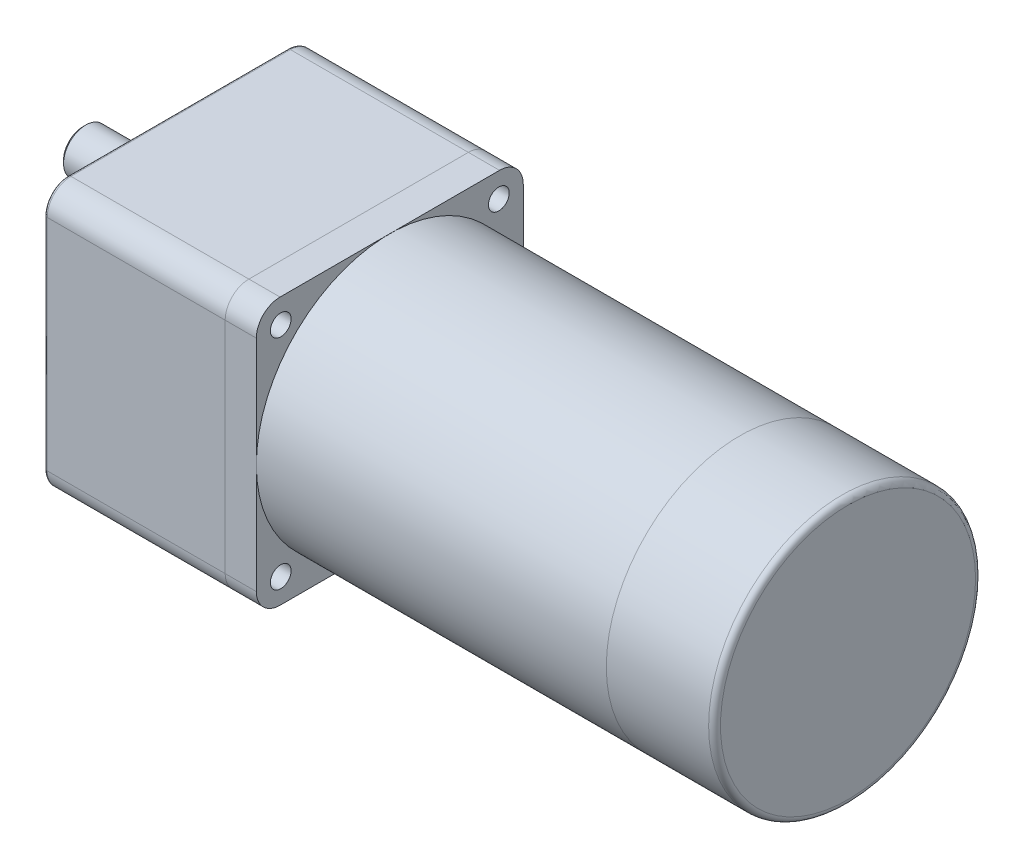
ISO-10303-21;
HEADER;
FILE_DESCRIPTION(('STEP AP214'),'2;1');
FILE_NAME('part.step','',(''),(''),'','','');
FILE_SCHEMA(('AUTOMOTIVE_DESIGN { 1 0 10303 214 1 1 1 1 }'));
ENDSEC;
DATA;
#1=APPLICATION_CONTEXT('core data for automotive mechanical design processes');
#2=APPLICATION_PROTOCOL_DEFINITION('international standard','automotive_design',2000,#1);
#3=PRODUCT_CONTEXT('',#1,'mechanical');
#4=PRODUCT('Part','Part','',(#3));
#5=PRODUCT_RELATED_PRODUCT_CATEGORY('part','',(#4));
#6=PRODUCT_DEFINITION_FORMATION('','',#4);
#7=PRODUCT_DEFINITION_CONTEXT('part definition',#1,'design');
#8=PRODUCT_DEFINITION('design','',#6,#7);
#9=PRODUCT_DEFINITION_SHAPE('','',#8);
#10=(LENGTH_UNIT() NAMED_UNIT(*) SI_UNIT(.MILLI.,.METRE.));
#11=(NAMED_UNIT(*) PLANE_ANGLE_UNIT() SI_UNIT($,.RADIAN.));
#12=(NAMED_UNIT(*) SI_UNIT($,.STERADIAN.) SOLID_ANGLE_UNIT());
#13=UNCERTAINTY_MEASURE_WITH_UNIT(LENGTH_MEASURE(1.E-05),#10,'distance_accuracy_value','');
#14=(GEOMETRIC_REPRESENTATION_CONTEXT(3) GLOBAL_UNCERTAINTY_ASSIGNED_CONTEXT((#13)) GLOBAL_UNIT_ASSIGNED_CONTEXT((#10,
#11,#12)) REPRESENTATION_CONTEXT('',''));
#15=CARTESIAN_POINT('',(0.,0.,0.));
#16=DIRECTION('',(0.,0.,1.));
#17=DIRECTION('',(1.,0.,0.));
#18=AXIS2_PLACEMENT_3D('',#15,#16,#17);
#19=CARTESIAN_POINT('',(226.,0.,0.));
#20=DIRECTION('',(-1.,0.,0.));
#21=DIRECTION('',(0.,0.,1.));
#22=AXIS2_PLACEMENT_3D('',#19,#20,#21);
#23=CYLINDRICAL_SURFACE('',#22,45.);
#24=CARTESIAN_POINT('',(224.,0.,0.));
#25=DIRECTION('',(1.,0.,0.));
#26=DIRECTION('',(0.,0.,-1.));
#27=AXIS2_PLACEMENT_3D('',#24,#25,#26);
#28=CIRCLE('',#27,45.);
#29=CARTESIAN_POINT('',(224.,0.,-45.));
#30=VERTEX_POINT('',#29);
#31=EDGE_CURVE('E11',#30,#30,#28,.F.);
#32=ORIENTED_EDGE('',*,*,#31,.T.);
#33=EDGE_LOOP('',(#32));
#34=FACE_BOUND('',#33,.T.);
#35=CARTESIAN_POINT('',(189.5,0.,0.));
#36=DIRECTION('',(1.,0.,0.));
#37=DIRECTION('',(0.,0.,-1.));
#38=AXIS2_PLACEMENT_3D('',#35,#36,#37);
#39=CIRCLE('',#38,45.);
#40=CARTESIAN_POINT('',(189.5,0.,-45.));
#41=VERTEX_POINT('',#40);
#42=EDGE_CURVE('E53',#41,#41,#39,.T.);
#43=ORIENTED_EDGE('',*,*,#42,.T.);
#44=EDGE_LOOP('',(#43));
#45=FACE_BOUND('',#44,.T.);
#46=ADVANCED_FACE('F42',(#34,#45),#23,.T.);
#47=CARTESIAN_POINT('',(226.,0.,0.));
#48=DIRECTION('',(1.,0.,0.));
#49=DIRECTION('',(0.,0.,-1.));
#50=AXIS2_PLACEMENT_3D('',#47,#48,#49);
#51=PLANE('',#50);
#52=CARTESIAN_POINT('',(226.,0.,0.));
#53=DIRECTION('',(1.,0.,0.));
#54=DIRECTION('',(0.,0.,-1.));
#55=AXIS2_PLACEMENT_3D('',#52,#53,#54);
#56=CIRCLE('',#55,43.);
#57=CARTESIAN_POINT('',(226.,0.,-43.));
#58=VERTEX_POINT('',#57);
#59=EDGE_CURVE('E49',#58,#58,#56,.T.);
#60=ORIENTED_EDGE('',*,*,#59,.T.);
#61=EDGE_LOOP('',(#60));
#62=FACE_BOUND('',#61,.T.);
#63=ADVANCED_FACE('F63',(#62),#51,.T.);
#64=CARTESIAN_POINT('',(189.5,0.,0.));
#65=DIRECTION('',(1.,0.,0.));
#66=DIRECTION('',(0.,0.,-1.));
#67=AXIS2_PLACEMENT_3D('',#64,#65,#66);
#68=PLANE('',#67);
#69=ORIENTED_EDGE('',*,*,#42,.F.);
#70=EDGE_LOOP('',(#69));
#71=FACE_BOUND('',#70,.T.);
#72=ADVANCED_FACE('F61',(#71),#68,.F.);
#73=CARTESIAN_POINT('',(224.,0.,0.));
#74=DIRECTION('',(1.,0.,0.));
#75=DIRECTION('',(0.,0.,-1.));
#76=AXIS2_PLACEMENT_3D('',#73,#74,#75);
#77=TOROIDAL_SURFACE('',#76,43.,2.);
#78=ORIENTED_EDGE('',*,*,#31,.F.);
#79=EDGE_LOOP('',(#78));
#80=FACE_BOUND('',#79,.T.);
#81=ORIENTED_EDGE('',*,*,#59,.F.);
#82=EDGE_LOOP('',(#81));
#83=FACE_BOUND('',#82,.T.);
#84=ADVANCED_FACE('F44',(#80,#83),#77,.T.);
#85=CLOSED_SHELL('',(#46,#63,#72,#84));
#86=MANIFOLD_SOLID_BREP('B2',#85);
#87=CARTESIAN_POINT('',(189.5,0.,0.));
#88=DIRECTION('',(-1.,0.,0.));
#89=DIRECTION('',(0.,0.,1.));
#90=AXIS2_PLACEMENT_3D('',#87,#88,#89);
#91=CYLINDRICAL_SURFACE('',#90,45.);
#92=CARTESIAN_POINT('',(189.5,0.,0.));
#93=DIRECTION('',(1.,0.,0.));
#94=DIRECTION('',(0.,0.,-1.));
#95=AXIS2_PLACEMENT_3D('',#92,#93,#94);
#96=CIRCLE('',#95,45.);
#97=CARTESIAN_POINT('',(189.5,0.,-45.));
#98=VERTEX_POINT('',#97);
#99=EDGE_CURVE('E41',#98,#98,#96,.T.);
#100=ORIENTED_EDGE('',*,*,#99,.F.);
#101=EDGE_LOOP('',(#100));
#102=FACE_BOUND('',#101,.T.);
#103=CARTESIAN_POINT('',(71.5,0.,0.));
#104=DIRECTION('',(1.,0.,0.));
#105=DIRECTION('',(0.,0.,-1.));
#106=AXIS2_PLACEMENT_3D('',#103,#104,#105);
#107=CIRCLE('',#106,45.);
#108=CARTESIAN_POINT('',(71.5,0.,-45.));
#109=VERTEX_POINT('',#108);
#110=EDGE_CURVE('E111',#109,#109,#107,.T.);
#111=ORIENTED_EDGE('',*,*,#110,.T.);
#112=EDGE_LOOP('',(#111));
#113=FACE_BOUND('',#112,.T.);
#114=ADVANCED_FACE('F108',(#102,#113),#91,.T.);
#115=CARTESIAN_POINT('',(189.5,0.,0.));
#116=DIRECTION('',(1.,0.,0.));
#117=DIRECTION('',(0.,0.,-1.));
#118=AXIS2_PLACEMENT_3D('',#115,#116,#117);
#119=PLANE('',#118);
#120=ORIENTED_EDGE('',*,*,#99,.T.);
#121=EDGE_LOOP('',(#120));
#122=FACE_BOUND('',#121,.T.);
#123=ADVANCED_FACE('F123',(#122),#119,.T.);
#124=CARTESIAN_POINT('',(71.5,0.,0.));
#125=DIRECTION('',(1.,0.,0.));
#126=DIRECTION('',(0.,0.,-1.));
#127=AXIS2_PLACEMENT_3D('',#124,#125,#126);
#128=PLANE('',#127);
#129=ORIENTED_EDGE('',*,*,#110,.F.);
#130=EDGE_LOOP('',(#129));
#131=FACE_BOUND('',#130,.T.);
#132=ADVANCED_FACE('F121',(#131),#128,.F.);
#133=CLOSED_SHELL('',(#114,#123,#132));
#134=MANIFOLD_SOLID_BREP('B6',#133);
#135=CARTESIAN_POINT('',(-32.,18.,0.));
#136=DIRECTION('',(1.,0.,0.));
#137=DIRECTION('',(0.,0.,-1.));
#138=AXIS2_PLACEMENT_3D('',#135,#136,#137);
#139=CYLINDRICAL_SURFACE('',#138,7.5);
#140=CARTESIAN_POINT('',(-3.,18.,0.));
#141=DIRECTION('',(-1.,0.,0.));
#142=DIRECTION('',(0.,0.,1.));
#143=AXIS2_PLACEMENT_3D('',#140,#141,#142);
#144=CIRCLE('',#143,7.5);
#145=CARTESIAN_POINT('',(-3.,18.,7.5));
#146=VERTEX_POINT('',#145);
#147=EDGE_CURVE('E237',#146,#146,#144,.T.);
#148=ORIENTED_EDGE('',*,*,#147,.T.);
#149=EDGE_LOOP('',(#148));
#150=FACE_BOUND('',#149,.T.);
#151=DIRECTION('',(1.,0.,0.));
#152=VECTOR('',#151,1.);
#153=CARTESIAN_POINT('',(-32.,20.5,-7.07106781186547));
#154=LINE('',#153,#152);
#155=CARTESIAN_POINT('',(-31.,20.5,-7.07106781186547));
#156=VERTEX_POINT('',#155);
#157=CARTESIAN_POINT('',(-9.5,20.5,-7.07106781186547));
#158=VERTEX_POINT('',#157);
#159=EDGE_CURVE('E226',#156,#158,#154,.T.);
#160=ORIENTED_EDGE('',*,*,#159,.F.);
#161=CARTESIAN_POINT('',(-31.,18.,0.));
#162=DIRECTION('',(-1.,0.,0.));
#163=DIRECTION('',(0.,0.,1.));
#164=AXIS2_PLACEMENT_3D('',#161,#162,#163);
#165=CIRCLE('',#164,7.5);
#166=CARTESIAN_POINT('',(-31.,15.5,-7.07106781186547));
#167=VERTEX_POINT('',#166);
#168=EDGE_CURVE('E170',#156,#167,#165,.F.);
#169=ORIENTED_EDGE('',*,*,#168,.T.);
#170=DIRECTION('',(1.,0.,0.));
#171=VECTOR('',#170,1.);
#172=CARTESIAN_POINT('',(-32.,15.5,-7.07106781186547));
#173=LINE('',#172,#171);
#174=CARTESIAN_POINT('',(-9.5,15.5,-7.07106781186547));
#175=VERTEX_POINT('',#174);
#176=EDGE_CURVE('E228',#175,#167,#173,.F.);
#177=ORIENTED_EDGE('',*,*,#176,.F.);
#178=CARTESIAN_POINT('',(-9.5,20.5,-7.07106781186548));
#179=CARTESIAN_POINT('',(-9.43179292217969,20.5000089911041,-7.07105693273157));
#180=CARTESIAN_POINT('',(-9.36359192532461,20.4972088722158,-7.07205443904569));
#181=CARTESIAN_POINT('',(-9.22771896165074,20.4860604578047,-7.07598524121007));
#182=CARTESIAN_POINT('',(-9.16004685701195,20.477713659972,-7.07891801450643));
#183=CARTESIAN_POINT('',(-9.02590951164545,20.455574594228,-7.08662705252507));
#184=CARTESIAN_POINT('',(-8.95944129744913,20.4417984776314,-7.09139784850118));
#185=CARTESIAN_POINT('',(-8.8279917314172,20.4089418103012,-7.10262619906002));
#186=CARTESIAN_POINT('',(-8.7630104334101,20.3898610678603,-7.10908381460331));
#187=CARTESIAN_POINT('',(-8.57103842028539,20.324915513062,-7.13069940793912));
#188=CARTESIAN_POINT('',(-8.44682084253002,20.2713141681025,-7.14811243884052));
#189=CARTESIAN_POINT('',(-8.20912318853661,20.1451778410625,-7.1869703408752));
#190=CARTESIAN_POINT('',(-8.09564976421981,20.0726312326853,-7.20841768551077));
#191=CARTESIAN_POINT('',(-7.8782070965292,19.9076299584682,-7.25386182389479));
#192=CARTESIAN_POINT('',(-7.7747148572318,19.8145628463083,-7.27792189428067));
#193=CARTESIAN_POINT('',(-7.5844828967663,19.6124707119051,-7.32534626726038));
#194=CARTESIAN_POINT('',(-7.497746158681,19.5034428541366,-7.34871044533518));
#195=CARTESIAN_POINT('',(-7.34130177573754,19.2690092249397,-7.39284706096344));
#196=CARTESIAN_POINT('',(-7.27209769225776,19.1432502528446,-7.41353593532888));
#197=CARTESIAN_POINT('',(-7.1560192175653,18.8810730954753,-7.44924021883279));
#198=CARTESIAN_POINT('',(-7.10913800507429,18.7446581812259,-7.46425736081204));
#199=CARTESIAN_POINT('',(-7.04066072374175,18.4700733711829,-7.48647677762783));
#200=CARTESIAN_POINT('',(-7.01824182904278,18.3321295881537,-7.49393272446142));
#201=CARTESIAN_POINT('',(-6.99670924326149,18.0542474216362,-7.50109021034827));
#202=CARTESIAN_POINT('',(-6.99758999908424,17.9143095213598,-7.50079359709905));
#203=CARTESIAN_POINT('',(-7.0221107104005,17.6422403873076,-7.49265096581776));
#204=CARTESIAN_POINT('',(-7.04485659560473,17.5100182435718,-7.48510152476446));
#205=CARTESIAN_POINT('',(-7.1109829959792,17.2513898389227,-7.46367401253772));
#206=CARTESIAN_POINT('',(-7.15436465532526,17.1249839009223,-7.44979559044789));
#207=CARTESIAN_POINT('',(-7.26105342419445,16.8796184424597,-7.41689170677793));
#208=CARTESIAN_POINT('',(-7.32461511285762,16.760778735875,-7.39780094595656));
#209=CARTESIAN_POINT('',(-7.46964987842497,16.5351885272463,-7.35645969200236));
#210=CARTESIAN_POINT('',(-7.55112782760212,16.4284413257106,-7.33420833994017));
#211=CARTESIAN_POINT('',(-7.73417762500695,16.2247566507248,-7.28765679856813));
#212=CARTESIAN_POINT('',(-7.83651385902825,16.128515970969,-7.26330946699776));
#213=CARTESIAN_POINT('',(-8.05610372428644,15.9543199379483,-7.21618726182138));
#214=CARTESIAN_POINT('',(-8.17336215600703,15.8763704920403,-7.19341289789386));
#215=CARTESIAN_POINT('',(-8.42170044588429,15.7399916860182,-7.15175078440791));
#216=CARTESIAN_POINT('',(-8.55295878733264,15.6818674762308,-7.13292537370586));
#217=CARTESIAN_POINT('',(-8.8241174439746,15.5888494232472,-7.10202742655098));
#218=CARTESIAN_POINT('',(-8.96400373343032,15.5539189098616,-7.08994423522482));
#219=CARTESIAN_POINT('',(-9.17104659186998,15.5208546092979,-7.078413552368));
#220=CARTESIAN_POINT('',(-9.23660347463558,15.5130373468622,-7.07566669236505));
#221=CARTESIAN_POINT('',(-9.36809519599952,15.502613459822,-7.07199258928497));
#222=CARTESIAN_POINT('',(-9.43402943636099,15.5000001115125,-7.0710629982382));
#223=CARTESIAN_POINT('',(-9.5,15.5,-7.07106781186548));
#224=B_SPLINE_CURVE_WITH_KNOTS('',3,(#178,#179,#180,#181,#182,#183,#184,#185,#186,#187,#188,
#189,#190,#191,#192,#193,#194,#195,#196,#197,#198,#199,#200,#201,#202,#203,#204,#205,#206,#207,
#208,#209,#210,#211,#212,#213,#214,#215,#216,#217,#218,#219,#220,#221,#222,#223),.UNSPECIFIED.,
.F.,.F.,(4,2,2,2,2,2,2,2,2,2,2,2,2,2,2,2,2,2,2,2,2,2,4),(0.,0.20454621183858,0.409037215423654,
0.612924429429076,0.816819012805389,1.22401016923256,1.63145179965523,2.0532786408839,
2.47518051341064,2.90809434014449,3.34087579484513,3.75860278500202,4.17623021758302,
4.57747647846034,4.97874498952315,5.38529148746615,5.79194868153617,6.21771736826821,
6.64362337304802,7.07581676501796,7.50732520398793,7.70536340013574,7.90314555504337),.UNSPECIFIED.);
#225=EDGE_CURVE('E240',#158,#175,#224,.T.);
#226=ORIENTED_EDGE('',*,*,#225,.F.);
#227=EDGE_LOOP('',(#160,#169,#177,#226));
#228=FACE_BOUND('',#227,.T.);
#229=ADVANCED_FACE('F157',(#150,#228),#139,.T.);
#230=CARTESIAN_POINT('',(-32.,18.,0.));
#231=DIRECTION('',(-1.,0.,0.));
#232=DIRECTION('',(0.,0.,1.));
#233=AXIS2_PLACEMENT_3D('',#230,#231,#232);
#234=PLANE('',#233);
#235=DIRECTION('',(0.,0.,-1.));
#236=VECTOR('',#235,1.);
#237=CARTESIAN_POINT('',(-32.,15.5,-4.5));
#238=LINE('',#237,#236);
#239=CARTESIAN_POINT('',(-32.,15.5,-4.5));
#240=VERTEX_POINT('',#239);
#241=CARTESIAN_POINT('',(-32.,15.5,-6.00000000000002));
#242=VERTEX_POINT('',#241);
#243=EDGE_CURVE('E232',#240,#242,#238,.T.);
#244=ORIENTED_EDGE('',*,*,#243,.T.);
#245=CARTESIAN_POINT('',(-32.,18.,0.));
#246=DIRECTION('',(-1.,0.,0.));
#247=DIRECTION('',(0.,0.,1.));
#248=AXIS2_PLACEMENT_3D('',#245,#246,#247);
#249=CIRCLE('',#248,6.50000000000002);
#250=CARTESIAN_POINT('',(-32.,20.5,-6.00000000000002));
#251=VERTEX_POINT('',#250);
#252=EDGE_CURVE('E246',#242,#251,#249,.T.);
#253=ORIENTED_EDGE('',*,*,#252,.T.);
#254=DIRECTION('',(0.,0.,-1.));
#255=VECTOR('',#254,1.);
#256=CARTESIAN_POINT('',(-32.,20.5,-4.5));
#257=LINE('',#256,#255);
#258=CARTESIAN_POINT('',(-32.,20.5,-4.5));
#259=VERTEX_POINT('',#258);
#260=EDGE_CURVE('E229',#259,#251,#257,.T.);
#261=ORIENTED_EDGE('',*,*,#260,.F.);
#262=DIRECTION('',(0.,-1.,0.));
#263=VECTOR('',#262,1.);
#264=CARTESIAN_POINT('',(-32.,20.5,-4.5));
#265=LINE('',#264,#263);
#266=EDGE_CURVE('E213',#259,#240,#265,.T.);
#267=ORIENTED_EDGE('',*,*,#266,.T.);
#268=EDGE_LOOP('',(#244,#253,#261,#267));
#269=FACE_BOUND('',#268,.T.);
#270=ADVANCED_FACE('F256',(#269),#234,.T.);
#271=CARTESIAN_POINT('',(-3.,18.,0.));
#272=DIRECTION('',(-1.,0.,0.));
#273=DIRECTION('',(0.,0.,1.));
#274=AXIS2_PLACEMENT_3D('',#271,#272,#273);
#275=PLANE('',#274);
#276=ORIENTED_EDGE('',*,*,#147,.F.);
#277=EDGE_LOOP('',(#276));
#278=FACE_BOUND('',#277,.T.);
#279=ADVANCED_FACE('F254',(#278),#275,.F.);
#280=CARTESIAN_POINT('',(-9.5,18.,-4.5));
#281=DIRECTION('',(0.,0.,-1.));
#282=DIRECTION('',(-1.,0.,0.));
#283=AXIS2_PLACEMENT_3D('',#280,#281,#282);
#284=CYLINDRICAL_SURFACE('',#283,2.5);
#285=DIRECTION('',(0.,0.,-1.));
#286=VECTOR('',#285,1.);
#287=CARTESIAN_POINT('',(-9.5,20.5,-4.5));
#288=LINE('',#287,#286);
#289=CARTESIAN_POINT('',(-9.5,20.5,-4.5));
#290=VERTEX_POINT('',#289);
#291=EDGE_CURVE('E221',#290,#158,#288,.T.);
#292=ORIENTED_EDGE('',*,*,#291,.T.);
#293=ORIENTED_EDGE('',*,*,#225,.T.);
#294=DIRECTION('',(0.,0.,-1.));
#295=VECTOR('',#294,1.);
#296=CARTESIAN_POINT('',(-9.5,15.5,-4.5));
#297=LINE('',#296,#295);
#298=CARTESIAN_POINT('',(-9.5,15.5,-4.5));
#299=VERTEX_POINT('',#298);
#300=EDGE_CURVE('E223',#299,#175,#297,.T.);
#301=ORIENTED_EDGE('',*,*,#300,.F.);
#302=CARTESIAN_POINT('',(-9.5,18.,-4.5));
#303=DIRECTION('',(0.,0.,1.));
#304=DIRECTION('',(1.,0.,0.));
#305=AXIS2_PLACEMENT_3D('',#302,#303,#304);
#306=CIRCLE('',#305,2.5);
#307=EDGE_CURVE('E211',#299,#290,#306,.T.);
#308=ORIENTED_EDGE('',*,*,#307,.T.);
#309=EDGE_LOOP('',(#292,#293,#301,#308));
#310=FACE_BOUND('',#309,.T.);
#311=ADVANCED_FACE('F220',(#310),#284,.F.);
#312=CARTESIAN_POINT('',(-9.5,20.5,-4.5));
#313=DIRECTION('',(0.,-1.,0.));
#314=DIRECTION('',(0.,0.,-1.));
#315=AXIS2_PLACEMENT_3D('',#312,#313,#314);
#316=PLANE('',#315);
#317=ORIENTED_EDGE('',*,*,#260,.T.);
#318=CARTESIAN_POINT('',(-32.,20.5,-6.00000000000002));
#319=CARTESIAN_POINT('',(-31.9171731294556,20.5,-6.0897273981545));
#320=CARTESIAN_POINT('',(-31.8341996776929,20.5,-6.17931930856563));
#321=CARTESIAN_POINT('',(-31.6679908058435,20.5,-6.35825867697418));
#322=CARTESIAN_POINT('',(-31.5847553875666,20.5,-6.44760613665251));
#323=CARTESIAN_POINT('',(-31.4180527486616,20.5,-6.62608424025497));
#324=CARTESIAN_POINT('',(-31.3345855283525,20.5,-6.7152148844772));
#325=CARTESIAN_POINT('',(-31.1674427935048,20.5,-6.89328182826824));
#326=CARTESIAN_POINT('',(-31.0837672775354,20.5,-6.98221812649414));
#327=CARTESIAN_POINT('',(-31.,20.5,-7.07106781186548));
#328=B_SPLINE_CURVE_WITH_KNOTS('',3,(#318,#319,#320,#321,#322,#323,#324,#325,#326,#327),
.UNSPECIFIED.,.F.,.F.,(4,2,2,2,4),(0.,0.366335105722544,0.732667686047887,1.0989997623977,
1.46533436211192),.UNSPECIFIED.);
#329=EDGE_CURVE('E184',#251,#156,#328,.T.);
#330=ORIENTED_EDGE('',*,*,#329,.T.);
#331=ORIENTED_EDGE('',*,*,#159,.T.);
#332=ORIENTED_EDGE('',*,*,#291,.F.);
#333=DIRECTION('',(-1.,0.,0.));
#334=VECTOR('',#333,1.);
#335=CARTESIAN_POINT('',(-9.5,20.5,-4.5));
#336=LINE('',#335,#334);
#337=EDGE_CURVE('E208',#290,#259,#336,.T.);
#338=ORIENTED_EDGE('',*,*,#337,.T.);
#339=EDGE_LOOP('',(#317,#330,#331,#332,#338));
#340=FACE_BOUND('',#339,.T.);
#341=ADVANCED_FACE('F225',(#340),#316,.T.);
#342=CARTESIAN_POINT('',(-32.,15.5,-4.5));
#343=DIRECTION('',(0.,1.,0.));
#344=DIRECTION('',(0.,0.,1.));
#345=AXIS2_PLACEMENT_3D('',#342,#343,#344);
#346=PLANE('',#345);
#347=ORIENTED_EDGE('',*,*,#176,.T.);
#348=CARTESIAN_POINT('',(-31.,15.5,-7.07106781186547));
#349=CARTESIAN_POINT('',(-31.0837672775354,15.5,-6.98221812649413));
#350=CARTESIAN_POINT('',(-31.1674427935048,15.5,-6.89328182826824));
#351=CARTESIAN_POINT('',(-31.3345855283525,15.5,-6.7152148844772));
#352=CARTESIAN_POINT('',(-31.4180527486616,15.5,-6.62608424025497));
#353=CARTESIAN_POINT('',(-31.5847553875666,15.5,-6.44760613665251));
#354=CARTESIAN_POINT('',(-31.6679908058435,15.5,-6.35825867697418));
#355=CARTESIAN_POINT('',(-31.8341996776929,15.5,-6.17931930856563));
#356=CARTESIAN_POINT('',(-31.9171731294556,15.5,-6.08972739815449));
#357=CARTESIAN_POINT('',(-32.,15.5,-6.00000000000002));
#358=B_SPLINE_CURVE_WITH_KNOTS('',3,(#348,#349,#350,#351,#352,#353,#354,#355,#356,#357),
.UNSPECIFIED.,.F.,.F.,(4,2,2,2,4),(0.,0.366334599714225,0.732666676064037,1.09899925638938,
1.46533436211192),.UNSPECIFIED.);
#359=EDGE_CURVE('E106',#167,#242,#358,.T.);
#360=ORIENTED_EDGE('',*,*,#359,.T.);
#361=ORIENTED_EDGE('',*,*,#243,.F.);
#362=DIRECTION('',(1.,0.,0.));
#363=VECTOR('',#362,1.);
#364=CARTESIAN_POINT('',(-32.,15.5,-4.5));
#365=LINE('',#364,#363);
#366=EDGE_CURVE('E278',#240,#299,#365,.T.);
#367=ORIENTED_EDGE('',*,*,#366,.T.);
#368=ORIENTED_EDGE('',*,*,#300,.T.);
#369=EDGE_LOOP('',(#347,#360,#361,#367,#368));
#370=FACE_BOUND('',#369,.T.);
#371=ADVANCED_FACE('F282',(#370),#346,.T.);
#372=CARTESIAN_POINT('',(-9.5,18.,-4.5));
#373=DIRECTION('',(0.,0.,1.));
#374=DIRECTION('',(1.,0.,0.));
#375=AXIS2_PLACEMENT_3D('',#372,#373,#374);
#376=PLANE('',#375);
#377=ORIENTED_EDGE('',*,*,#307,.F.);
#378=ORIENTED_EDGE('',*,*,#366,.F.);
#379=ORIENTED_EDGE('',*,*,#266,.F.);
#380=ORIENTED_EDGE('',*,*,#337,.F.);
#381=EDGE_LOOP('',(#377,#378,#379,#380));
#382=FACE_BOUND('',#381,.T.);
#383=ADVANCED_FACE('F210',(#382),#376,.F.);
#384=CARTESIAN_POINT('',(-32.,18.,0.));
#385=DIRECTION('',(1.,0.,0.));
#386=DIRECTION('',(0.,0.,-1.));
#387=AXIS2_PLACEMENT_3D('',#384,#385,#386);
#388=CONICAL_SURFACE('',#387,6.50000000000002,0.785398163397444);
#389=ORIENTED_EDGE('',*,*,#359,.F.);
#390=ORIENTED_EDGE('',*,*,#168,.F.);
#391=ORIENTED_EDGE('',*,*,#329,.F.);
#392=ORIENTED_EDGE('',*,*,#252,.F.);
#393=EDGE_LOOP('',(#389,#390,#391,#392));
#394=FACE_BOUND('',#393,.T.);
#395=ADVANCED_FACE('F159',(#394),#388,.T.);
#396=CLOSED_SHELL('',(#229,#270,#279,#311,#341,#371,#383,#395));
#397=MANIFOLD_SOLID_BREP('B36',#396);
#398=CARTESIAN_POINT('',(-3.,18.,0.));
#399=DIRECTION('',(1.,0.,0.));
#400=DIRECTION('',(0.,0.,-1.));
#401=AXIS2_PLACEMENT_3D('',#398,#399,#400);
#402=CYLINDRICAL_SURFACE('',#401,16.);
#403=CARTESIAN_POINT('',(-2.5,18.,0.));
#404=DIRECTION('',(-1.,0.,0.));
#405=DIRECTION('',(0.,0.,1.));
#406=AXIS2_PLACEMENT_3D('',#403,#404,#405);
#407=CIRCLE('',#406,16.);
#408=CARTESIAN_POINT('',(-2.5,18.,16.));
#409=VERTEX_POINT('',#408);
#410=EDGE_CURVE('E156',#409,#409,#407,.F.);
#411=ORIENTED_EDGE('',*,*,#410,.T.);
#412=EDGE_LOOP('',(#411));
#413=FACE_BOUND('',#412,.T.);
#414=CARTESIAN_POINT('',(0.,18.,0.));
#415=DIRECTION('',(-1.,0.,0.));
#416=DIRECTION('',(0.,0.,1.));
#417=AXIS2_PLACEMENT_3D('',#414,#415,#416);
#418=CIRCLE('',#417,16.);
#419=CARTESIAN_POINT('',(0.,18.,16.));
#420=VERTEX_POINT('',#419);
#421=EDGE_CURVE('E358',#420,#420,#418,.T.);
#422=ORIENTED_EDGE('',*,*,#421,.T.);
#423=EDGE_LOOP('',(#422));
#424=FACE_BOUND('',#423,.T.);
#425=ADVANCED_FACE('F347',(#413,#424),#402,.T.);
#426=CARTESIAN_POINT('',(-3.,18.,0.));
#427=DIRECTION('',(-1.,0.,0.));
#428=DIRECTION('',(0.,0.,1.));
#429=AXIS2_PLACEMENT_3D('',#426,#427,#428);
#430=PLANE('',#429);
#431=CARTESIAN_POINT('',(-3.,18.,0.));
#432=DIRECTION('',(-1.,0.,0.));
#433=DIRECTION('',(0.,0.,1.));
#434=AXIS2_PLACEMENT_3D('',#431,#432,#433);
#435=CIRCLE('',#434,15.5);
#436=CARTESIAN_POINT('',(-3.,18.,15.5));
#437=VERTEX_POINT('',#436);
#438=EDGE_CURVE('E354',#437,#437,#435,.T.);
#439=ORIENTED_EDGE('',*,*,#438,.T.);
#440=EDGE_LOOP('',(#439));
#441=FACE_BOUND('',#440,.T.);
#442=ADVANCED_FACE('F368',(#441),#430,.T.);
#443=CARTESIAN_POINT('',(0.,18.,0.));
#444=DIRECTION('',(-1.,0.,0.));
#445=DIRECTION('',(0.,0.,1.));
#446=AXIS2_PLACEMENT_3D('',#443,#444,#445);
#447=PLANE('',#446);
#448=ORIENTED_EDGE('',*,*,#421,.F.);
#449=EDGE_LOOP('',(#448));
#450=FACE_BOUND('',#449,.T.);
#451=ADVANCED_FACE('F366',(#450),#447,.F.);
#452=CARTESIAN_POINT('',(-2.5,18.,0.));
#453=DIRECTION('',(-1.,0.,0.));
#454=DIRECTION('',(0.,0.,1.));
#455=AXIS2_PLACEMENT_3D('',#452,#453,#454);
#456=TOROIDAL_SURFACE('',#455,15.5,0.5);
#457=ORIENTED_EDGE('',*,*,#410,.F.);
#458=EDGE_LOOP('',(#457));
#459=FACE_BOUND('',#458,.T.);
#460=ORIENTED_EDGE('',*,*,#438,.F.);
#461=EDGE_LOOP('',(#460));
#462=FACE_BOUND('',#461,.T.);
#463=ADVANCED_FACE('F349',(#459,#462),#456,.T.);
#464=CLOSED_SHELL('',(#425,#442,#451,#463));
#465=MANIFOLD_SOLID_BREP('B100',#464);
#466=CARTESIAN_POINT('',(71.5,37.,-37.));
#467=DIRECTION('',(-1.,0.,0.));
#468=DIRECTION('',(0.,0.,1.));
#469=AXIS2_PLACEMENT_3D('',#466,#467,#468);
#470=CYLINDRICAL_SURFACE('',#469,8.);
#471=CARTESIAN_POINT('',(61.,37.,-37.));
#472=DIRECTION('',(1.,0.,0.));
#473=DIRECTION('',(0.,0.,1.));
#474=AXIS2_PLACEMENT_3D('',#471,#472,#473);
#475=CIRCLE('',#474,8.);
#476=CARTESIAN_POINT('',(61.,37.,-45.));
#477=VERTEX_POINT('',#476);
#478=CARTESIAN_POINT('',(61.,45.,-36.9999999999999));
#479=VERTEX_POINT('',#478);
#480=EDGE_CURVE('E510',#477,#479,#475,.T.);
#481=ORIENTED_EDGE('',*,*,#480,.T.);
#482=DIRECTION('',(-1.,0.,0.));
#483=VECTOR('',#482,1.);
#484=CARTESIAN_POINT('',(71.5,45.,-36.9999999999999));
#485=LINE('',#484,#483);
#486=CARTESIAN_POINT('',(71.5,45.,-36.9999999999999));
#487=VERTEX_POINT('',#486);
#488=EDGE_CURVE('E345',#487,#479,#485,.T.);
#489=ORIENTED_EDGE('',*,*,#488,.F.);
#490=CARTESIAN_POINT('',(71.5,37.,-37.));
#491=DIRECTION('',(1.,0.,0.));
#492=DIRECTION('',(0.,0.,1.));
#493=AXIS2_PLACEMENT_3D('',#490,#491,#492);
#494=CIRCLE('',#493,8.);
#495=CARTESIAN_POINT('',(71.5,37.,-45.));
#496=VERTEX_POINT('',#495);
#497=EDGE_CURVE('E524',#496,#487,#494,.T.);
#498=ORIENTED_EDGE('',*,*,#497,.F.);
#499=DIRECTION('',(-1.,0.,0.));
#500=VECTOR('',#499,1.);
#501=CARTESIAN_POINT('',(71.5,37.,-45.));
#502=LINE('',#501,#500);
#503=EDGE_CURVE('E506',#496,#477,#502,.T.);
#504=ORIENTED_EDGE('',*,*,#503,.T.);
#505=EDGE_LOOP('',(#481,#489,#498,#504));
#506=FACE_BOUND('',#505,.T.);
#507=ADVANCED_FACE('F412',(#506),#470,.T.);
#508=CARTESIAN_POINT('',(71.5,45.,36.9999999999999));
#509=DIRECTION('',(0.,-1.,0.));
#510=DIRECTION('',(0.,0.,-1.));
#511=AXIS2_PLACEMENT_3D('',#508,#509,#510);
#512=PLANE('',#511);
#513=DIRECTION('',(0.,0.,1.));
#514=VECTOR('',#513,1.);
#515=CARTESIAN_POINT('',(61.,45.,36.9999999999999));
#516=LINE('',#515,#514);
#517=CARTESIAN_POINT('',(61.,45.,36.9999999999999));
#518=VERTEX_POINT('',#517);
#519=EDGE_CURVE('E513',#479,#518,#516,.T.);
#520=ORIENTED_EDGE('',*,*,#519,.T.);
#521=DIRECTION('',(-1.,0.,0.));
#522=VECTOR('',#521,1.);
#523=CARTESIAN_POINT('',(71.5,45.,36.9999999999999));
#524=LINE('',#523,#522);
#525=CARTESIAN_POINT('',(71.5,45.,36.9999999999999));
#526=VERTEX_POINT('',#525);
#527=EDGE_CURVE('E421',#526,#518,#524,.T.);
#528=ORIENTED_EDGE('',*,*,#527,.F.);
#529=DIRECTION('',(0.,0.,1.));
#530=VECTOR('',#529,1.);
#531=CARTESIAN_POINT('',(71.5,45.,36.9999999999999));
#532=LINE('',#531,#530);
#533=EDGE_CURVE('E473',#487,#526,#532,.T.);
#534=ORIENTED_EDGE('',*,*,#533,.F.);
#535=ORIENTED_EDGE('',*,*,#488,.T.);
#536=EDGE_LOOP('',(#520,#528,#534,#535));
#537=FACE_BOUND('',#536,.T.);
#538=ADVANCED_FACE('F578',(#537),#512,.F.);
#539=CARTESIAN_POINT('',(71.5,37.,37.));
#540=DIRECTION('',(-1.,0.,0.));
#541=DIRECTION('',(0.,0.,1.));
#542=AXIS2_PLACEMENT_3D('',#539,#540,#541);
#543=CYLINDRICAL_SURFACE('',#542,8.);
#544=CARTESIAN_POINT('',(61.,37.,37.));
#545=DIRECTION('',(1.,0.,0.));
#546=DIRECTION('',(0.,0.,1.));
#547=AXIS2_PLACEMENT_3D('',#544,#545,#546);
#548=CIRCLE('',#547,8.);
#549=CARTESIAN_POINT('',(61.,37.,45.));
#550=VERTEX_POINT('',#549);
#551=EDGE_CURVE('E515',#518,#550,#548,.T.);
#552=ORIENTED_EDGE('',*,*,#551,.T.);
#553=DIRECTION('',(-1.,0.,0.));
#554=VECTOR('',#553,1.);
#555=CARTESIAN_POINT('',(71.5,37.,45.));
#556=LINE('',#555,#554);
#557=CARTESIAN_POINT('',(71.5,37.,45.));
#558=VERTEX_POINT('',#557);
#559=EDGE_CURVE('E531',#558,#550,#556,.T.);
#560=ORIENTED_EDGE('',*,*,#559,.F.);
#561=CARTESIAN_POINT('',(71.5,37.,37.));
#562=DIRECTION('',(1.,0.,0.));
#563=DIRECTION('',(0.,0.,1.));
#564=AXIS2_PLACEMENT_3D('',#561,#562,#563);
#565=CIRCLE('',#564,8.);
#566=EDGE_CURVE('E679',#526,#558,#565,.T.);
#567=ORIENTED_EDGE('',*,*,#566,.F.);
#568=ORIENTED_EDGE('',*,*,#527,.T.);
#569=EDGE_LOOP('',(#552,#560,#567,#568));
#570=FACE_BOUND('',#569,.T.);
#571=ADVANCED_FACE('F582',(#570),#543,.T.);
#572=CARTESIAN_POINT('',(71.5,-37.,45.));
#573=DIRECTION('',(0.,0.,-1.));
#574=DIRECTION('',(-1.,0.,0.));
#575=AXIS2_PLACEMENT_3D('',#572,#573,#574);
#576=PLANE('',#575);
#577=DIRECTION('',(0.,-1.,0.));
#578=VECTOR('',#577,1.);
#579=CARTESIAN_POINT('',(61.,-37.,45.));
#580=LINE('',#579,#578);
#581=CARTESIAN_POINT('',(61.,-37.,45.));
#582=VERTEX_POINT('',#581);
#583=EDGE_CURVE('E517',#550,#582,#580,.T.);
#584=ORIENTED_EDGE('',*,*,#583,.T.);
#585=DIRECTION('',(-1.,0.,0.));
#586=VECTOR('',#585,1.);
#587=CARTESIAN_POINT('',(71.5,-37.,45.));
#588=LINE('',#587,#586);
#589=CARTESIAN_POINT('',(71.5,-37.,45.));
#590=VERTEX_POINT('',#589);
#591=EDGE_CURVE('E528',#590,#582,#588,.T.);
#592=ORIENTED_EDGE('',*,*,#591,.F.);
#593=DIRECTION('',(0.,-1.,0.));
#594=VECTOR('',#593,1.);
#595=CARTESIAN_POINT('',(71.5,-37.,45.));
#596=LINE('',#595,#594);
#597=EDGE_CURVE('E681',#558,#590,#596,.T.);
#598=ORIENTED_EDGE('',*,*,#597,.F.);
#599=ORIENTED_EDGE('',*,*,#559,.T.);
#600=EDGE_LOOP('',(#584,#592,#598,#599));
#601=FACE_BOUND('',#600,.T.);
#602=ADVANCED_FACE('F586',(#601),#576,.F.);
#603=CARTESIAN_POINT('',(71.5,-37.,37.));
#604=DIRECTION('',(-1.,0.,0.));
#605=DIRECTION('',(0.,0.,1.));
#606=AXIS2_PLACEMENT_3D('',#603,#604,#605);
#607=CYLINDRICAL_SURFACE('',#606,8.);
#608=CARTESIAN_POINT('',(61.,-37.,37.));
#609=DIRECTION('',(1.,0.,0.));
#610=DIRECTION('',(0.,0.,1.));
#611=AXIS2_PLACEMENT_3D('',#608,#609,#610);
#612=CIRCLE('',#611,8.);
#613=CARTESIAN_POINT('',(61.,-45.,36.9999999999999));
#614=VERTEX_POINT('',#613);
#615=EDGE_CURVE('E519',#582,#614,#612,.T.);
#616=ORIENTED_EDGE('',*,*,#615,.T.);
#617=DIRECTION('',(-1.,0.,0.));
#618=VECTOR('',#617,1.);
#619=CARTESIAN_POINT('',(71.5,-45.,36.9999999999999));
#620=LINE('',#619,#618);
#621=CARTESIAN_POINT('',(71.5,-45.,36.9999999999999));
#622=VERTEX_POINT('',#621);
#623=EDGE_CURVE('E501',#622,#614,#620,.T.);
#624=ORIENTED_EDGE('',*,*,#623,.F.);
#625=CARTESIAN_POINT('',(71.5,-37.,37.));
#626=DIRECTION('',(1.,0.,0.));
#627=DIRECTION('',(0.,0.,1.));
#628=AXIS2_PLACEMENT_3D('',#625,#626,#627);
#629=CIRCLE('',#628,8.);
#630=EDGE_CURVE('E492',#590,#622,#629,.T.);
#631=ORIENTED_EDGE('',*,*,#630,.F.);
#632=ORIENTED_EDGE('',*,*,#591,.T.);
#633=EDGE_LOOP('',(#616,#624,#631,#632));
#634=FACE_BOUND('',#633,.T.);
#635=ADVANCED_FACE('F592',(#634),#607,.T.);
#636=CARTESIAN_POINT('',(71.5,-45.,36.9999999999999));
#637=DIRECTION('',(0.,1.,0.));
#638=DIRECTION('',(0.,0.,1.));
#639=AXIS2_PLACEMENT_3D('',#636,#637,#638);
#640=PLANE('',#639);
#641=DIRECTION('',(0.,0.,-1.));
#642=VECTOR('',#641,1.);
#643=CARTESIAN_POINT('',(61.,-45.,36.9999999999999));
#644=LINE('',#643,#642);
#645=CARTESIAN_POINT('',(61.,-45.,-36.9999999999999));
#646=VERTEX_POINT('',#645);
#647=EDGE_CURVE('E500',#614,#646,#644,.T.);
#648=ORIENTED_EDGE('',*,*,#647,.T.);
#649=DIRECTION('',(-1.,0.,0.));
#650=VECTOR('',#649,1.);
#651=CARTESIAN_POINT('',(71.5,-45.,-36.9999999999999));
#652=LINE('',#651,#650);
#653=CARTESIAN_POINT('',(71.5,-45.,-36.9999999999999));
#654=VERTEX_POINT('',#653);
#655=EDGE_CURVE('E497',#654,#646,#652,.T.);
#656=ORIENTED_EDGE('',*,*,#655,.F.);
#657=DIRECTION('',(0.,0.,-1.));
#658=VECTOR('',#657,1.);
#659=CARTESIAN_POINT('',(71.5,-45.,36.9999999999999));
#660=LINE('',#659,#658);
#661=EDGE_CURVE('E486',#622,#654,#660,.T.);
#662=ORIENTED_EDGE('',*,*,#661,.F.);
#663=ORIENTED_EDGE('',*,*,#623,.T.);
#664=EDGE_LOOP('',(#648,#656,#662,#663));
#665=FACE_BOUND('',#664,.T.);
#666=ADVANCED_FACE('F498',(#665),#640,.F.);
#667=CARTESIAN_POINT('',(71.5,-37.,-37.));
#668=DIRECTION('',(-1.,0.,0.));
#669=DIRECTION('',(0.,0.,1.));
#670=AXIS2_PLACEMENT_3D('',#667,#668,#669);
#671=CYLINDRICAL_SURFACE('',#670,8.);
#672=CARTESIAN_POINT('',(61.,-37.,-37.));
#673=DIRECTION('',(1.,0.,0.));
#674=DIRECTION('',(0.,0.,-1.));
#675=AXIS2_PLACEMENT_3D('',#672,#673,#674);
#676=CIRCLE('',#675,8.);
#677=CARTESIAN_POINT('',(61.,-37.,-45.));
#678=VERTEX_POINT('',#677);
#679=EDGE_CURVE('E459',#646,#678,#676,.T.);
#680=ORIENTED_EDGE('',*,*,#679,.T.);
#681=DIRECTION('',(-1.,0.,0.));
#682=VECTOR('',#681,1.);
#683=CARTESIAN_POINT('',(71.5,-37.,-45.));
#684=LINE('',#683,#682);
#685=CARTESIAN_POINT('',(71.5,-37.,-45.));
#686=VERTEX_POINT('',#685);
#687=EDGE_CURVE('E502',#686,#678,#684,.T.);
#688=ORIENTED_EDGE('',*,*,#687,.F.);
#689=CARTESIAN_POINT('',(71.5,-37.,-37.));
#690=DIRECTION('',(1.,0.,0.));
#691=DIRECTION('',(0.,0.,-1.));
#692=AXIS2_PLACEMENT_3D('',#689,#690,#691);
#693=CIRCLE('',#692,8.);
#694=EDGE_CURVE('E490',#654,#686,#693,.T.);
#695=ORIENTED_EDGE('',*,*,#694,.F.);
#696=ORIENTED_EDGE('',*,*,#655,.T.);
#697=EDGE_LOOP('',(#680,#688,#695,#696));
#698=FACE_BOUND('',#697,.T.);
#699=ADVANCED_FACE('F504',(#698),#671,.T.);
#700=CARTESIAN_POINT('',(71.5,-37.,-45.));
#701=DIRECTION('',(0.,0.,1.));
#702=DIRECTION('',(1.,0.,0.));
#703=AXIS2_PLACEMENT_3D('',#700,#701,#702);
#704=PLANE('',#703);
#705=DIRECTION('',(0.,1.,0.));
#706=VECTOR('',#705,1.);
#707=CARTESIAN_POINT('',(61.,-37.,-45.));
#708=LINE('',#707,#706);
#709=EDGE_CURVE('E465',#678,#477,#708,.T.);
#710=ORIENTED_EDGE('',*,*,#709,.T.);
#711=ORIENTED_EDGE('',*,*,#503,.F.);
#712=DIRECTION('',(0.,1.,0.));
#713=VECTOR('',#712,1.);
#714=CARTESIAN_POINT('',(71.5,-37.,-45.));
#715=LINE('',#714,#713);
#716=EDGE_CURVE('E430',#686,#496,#715,.T.);
#717=ORIENTED_EDGE('',*,*,#716,.F.);
#718=ORIENTED_EDGE('',*,*,#687,.T.);
#719=EDGE_LOOP('',(#710,#711,#717,#718));
#720=FACE_BOUND('',#719,.T.);
#721=ADVANCED_FACE('F567',(#720),#704,.F.);
#722=CARTESIAN_POINT('',(71.5,37.,-37.));
#723=DIRECTION('',(-1.,0.,0.));
#724=DIRECTION('',(0.,0.,1.));
#725=AXIS2_PLACEMENT_3D('',#722,#723,#724);
#726=PLANE('',#725);
#727=CARTESIAN_POINT('',(71.5,36.7695526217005,36.7695526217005));
#728=DIRECTION('',(1.,0.,0.));
#729=DIRECTION('',(0.,0.,-1.));
#730=AXIS2_PLACEMENT_3D('',#727,#728,#729);
#731=CIRCLE('',#730,3.5);
#732=CARTESIAN_POINT('',(71.5,36.7695526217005,33.2695526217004));
#733=VERTEX_POINT('',#732);
#734=EDGE_CURVE('E540',#733,#733,#731,.T.);
#735=ORIENTED_EDGE('',*,*,#734,.F.);
#736=EDGE_LOOP('',(#735));
#737=FACE_BOUND('',#736,.T.);
#738=CARTESIAN_POINT('',(71.5,36.7695526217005,-36.7695526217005));
#739=DIRECTION('',(1.,0.,0.));
#740=DIRECTION('',(0.,0.,-1.));
#741=AXIS2_PLACEMENT_3D('',#738,#739,#740);
#742=CIRCLE('',#741,3.5);
#743=CARTESIAN_POINT('',(71.5,36.7695526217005,-40.2695526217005));
#744=VERTEX_POINT('',#743);
#745=EDGE_CURVE('E665',#744,#744,#742,.T.);
#746=ORIENTED_EDGE('',*,*,#745,.F.);
#747=EDGE_LOOP('',(#746));
#748=FACE_BOUND('',#747,.T.);
#749=CARTESIAN_POINT('',(71.5,-36.7695526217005,-36.7695526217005));
#750=DIRECTION('',(1.,0.,0.));
#751=DIRECTION('',(0.,0.,-1.));
#752=AXIS2_PLACEMENT_3D('',#749,#750,#751);
#753=CIRCLE('',#752,3.5);
#754=CARTESIAN_POINT('',(71.5,-36.7695526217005,-40.2695526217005));
#755=VERTEX_POINT('',#754);
#756=EDGE_CURVE('E667',#755,#755,#753,.T.);
#757=ORIENTED_EDGE('',*,*,#756,.F.);
#758=EDGE_LOOP('',(#757));
#759=FACE_BOUND('',#758,.T.);
#760=CARTESIAN_POINT('',(71.5,-36.7695526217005,36.7695526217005));
#761=DIRECTION('',(1.,0.,0.));
#762=DIRECTION('',(0.,0.,-1.));
#763=AXIS2_PLACEMENT_3D('',#760,#761,#762);
#764=CIRCLE('',#763,3.5);
#765=CARTESIAN_POINT('',(71.5,-36.7695526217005,33.2695526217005));
#766=VERTEX_POINT('',#765);
#767=EDGE_CURVE('E672',#766,#766,#764,.T.);
#768=ORIENTED_EDGE('',*,*,#767,.F.);
#769=EDGE_LOOP('',(#768));
#770=FACE_BOUND('',#769,.T.);
#771=ORIENTED_EDGE('',*,*,#497,.T.);
#772=ORIENTED_EDGE('',*,*,#533,.T.);
#773=ORIENTED_EDGE('',*,*,#566,.T.);
#774=ORIENTED_EDGE('',*,*,#597,.T.);
#775=ORIENTED_EDGE('',*,*,#630,.T.);
#776=ORIENTED_EDGE('',*,*,#661,.T.);
#777=ORIENTED_EDGE('',*,*,#694,.T.);
#778=ORIENTED_EDGE('',*,*,#716,.T.);
#779=EDGE_LOOP('',(#771,#772,#773,#774,#775,#776,#777,#778));
#780=FACE_BOUND('',#779,.T.);
#781=ADVANCED_FACE('F488',(#737,#748,#759,#770,#780),#726,.F.);
#782=CARTESIAN_POINT('',(61.,37.,-37.));
#783=DIRECTION('',(-1.,0.,0.));
#784=DIRECTION('',(0.,0.,1.));
#785=AXIS2_PLACEMENT_3D('',#782,#783,#784);
#786=PLANE('',#785);
#787=CARTESIAN_POINT('',(61.,36.7695526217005,36.7695526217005));
#788=DIRECTION('',(-1.,0.,0.));
#789=DIRECTION('',(0.,0.,1.));
#790=AXIS2_PLACEMENT_3D('',#787,#788,#789);
#791=CIRCLE('',#790,3.5);
#792=CARTESIAN_POINT('',(61.,36.7695526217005,40.2695526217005));
#793=VERTEX_POINT('',#792);
#794=EDGE_CURVE('E415',#793,#793,#791,.T.);
#795=ORIENTED_EDGE('',*,*,#794,.F.);
#796=EDGE_LOOP('',(#795));
#797=FACE_BOUND('',#796,.T.);
#798=CARTESIAN_POINT('',(61.,36.7695526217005,-36.7695526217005));
#799=DIRECTION('',(-1.,0.,0.));
#800=DIRECTION('',(0.,0.,1.));
#801=AXIS2_PLACEMENT_3D('',#798,#799,#800);
#802=CIRCLE('',#801,3.5);
#803=CARTESIAN_POINT('',(61.,36.7695526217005,-33.2695526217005));
#804=VERTEX_POINT('',#803);
#805=EDGE_CURVE('E542',#804,#804,#802,.T.);
#806=ORIENTED_EDGE('',*,*,#805,.F.);
#807=EDGE_LOOP('',(#806));
#808=FACE_BOUND('',#807,.T.);
#809=CARTESIAN_POINT('',(61.,-36.7695526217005,-36.7695526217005));
#810=DIRECTION('',(-1.,0.,0.));
#811=DIRECTION('',(0.,0.,1.));
#812=AXIS2_PLACEMENT_3D('',#809,#810,#811);
#813=CIRCLE('',#812,3.5);
#814=CARTESIAN_POINT('',(61.,-36.7695526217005,-33.2695526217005));
#815=VERTEX_POINT('',#814);
#816=EDGE_CURVE('E539',#815,#815,#813,.T.);
#817=ORIENTED_EDGE('',*,*,#816,.F.);
#818=EDGE_LOOP('',(#817));
#819=FACE_BOUND('',#818,.T.);
#820=CARTESIAN_POINT('',(61.,-36.7695526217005,36.7695526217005));
#821=DIRECTION('',(-1.,0.,0.));
#822=DIRECTION('',(0.,0.,1.));
#823=AXIS2_PLACEMENT_3D('',#820,#821,#822);
#824=CIRCLE('',#823,3.5);
#825=CARTESIAN_POINT('',(61.,-36.7695526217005,40.2695526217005));
#826=VERTEX_POINT('',#825);
#827=EDGE_CURVE('E536',#826,#826,#824,.T.);
#828=ORIENTED_EDGE('',*,*,#827,.F.);
#829=EDGE_LOOP('',(#828));
#830=FACE_BOUND('',#829,.T.);
#831=ORIENTED_EDGE('',*,*,#480,.F.);
#832=ORIENTED_EDGE('',*,*,#709,.F.);
#833=ORIENTED_EDGE('',*,*,#679,.F.);
#834=ORIENTED_EDGE('',*,*,#647,.F.);
#835=ORIENTED_EDGE('',*,*,#615,.F.);
#836=ORIENTED_EDGE('',*,*,#583,.F.);
#837=ORIENTED_EDGE('',*,*,#551,.F.);
#838=ORIENTED_EDGE('',*,*,#519,.F.);
#839=EDGE_LOOP('',(#831,#832,#833,#834,#835,#836,#837,#838));
#840=FACE_BOUND('',#839,.T.);
#841=ADVANCED_FACE('F552',(#797,#808,#819,#830,#840),#786,.T.);
#842=CARTESIAN_POINT('',(9.49999999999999,-36.7695526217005,36.7695526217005));
#843=DIRECTION('',(1.,0.,0.));
#844=DIRECTION('',(0.,0.,-1.));
#845=AXIS2_PLACEMENT_3D('',#842,#843,#844);
#846=CYLINDRICAL_SURFACE('',#845,3.5);
#847=ORIENTED_EDGE('',*,*,#827,.T.);
#848=EDGE_LOOP('',(#847));
#849=FACE_BOUND('',#848,.T.);
#850=ORIENTED_EDGE('',*,*,#767,.T.);
#851=EDGE_LOOP('',(#850));
#852=FACE_BOUND('',#851,.T.);
#853=ADVANCED_FACE('F555',(#849,#852),#846,.F.);
#854=CARTESIAN_POINT('',(9.49999999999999,-36.7695526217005,-36.7695526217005));
#855=DIRECTION('',(1.,0.,0.));
#856=DIRECTION('',(0.,0.,-1.));
#857=AXIS2_PLACEMENT_3D('',#854,#855,#856);
#858=CYLINDRICAL_SURFACE('',#857,3.5);
#859=ORIENTED_EDGE('',*,*,#816,.T.);
#860=EDGE_LOOP('',(#859));
#861=FACE_BOUND('',#860,.T.);
#862=ORIENTED_EDGE('',*,*,#756,.T.);
#863=EDGE_LOOP('',(#862));
#864=FACE_BOUND('',#863,.T.);
#865=ADVANCED_FACE('F631',(#861,#864),#858,.F.);
#866=CARTESIAN_POINT('',(9.49999999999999,36.7695526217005,-36.7695526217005));
#867=DIRECTION('',(1.,0.,0.));
#868=DIRECTION('',(0.,0.,-1.));
#869=AXIS2_PLACEMENT_3D('',#866,#867,#868);
#870=CYLINDRICAL_SURFACE('',#869,3.5);
#871=ORIENTED_EDGE('',*,*,#805,.T.);
#872=EDGE_LOOP('',(#871));
#873=FACE_BOUND('',#872,.T.);
#874=ORIENTED_EDGE('',*,*,#745,.T.);
#875=EDGE_LOOP('',(#874));
#876=FACE_BOUND('',#875,.T.);
#877=ADVANCED_FACE('F641',(#873,#876),#870,.F.);
#878=CARTESIAN_POINT('',(9.49999999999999,36.7695526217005,36.7695526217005));
#879=DIRECTION('',(1.,0.,0.));
#880=DIRECTION('',(0.,0.,-1.));
#881=AXIS2_PLACEMENT_3D('',#878,#879,#880);
#882=CYLINDRICAL_SURFACE('',#881,3.5);
#883=ORIENTED_EDGE('',*,*,#794,.T.);
#884=EDGE_LOOP('',(#883));
#885=FACE_BOUND('',#884,.T.);
#886=ORIENTED_EDGE('',*,*,#734,.T.);
#887=EDGE_LOOP('',(#886));
#888=FACE_BOUND('',#887,.T.);
#889=ADVANCED_FACE('F549',(#885,#888),#882,.F.);
#890=CLOSED_SHELL('',(#507,#538,#571,#602,#635,#666,#699,#721,#781,#841,#853,#865,#877,#889));
#891=MANIFOLD_SOLID_BREP('B151',#890);
#892=CARTESIAN_POINT('',(0.,-36.7695526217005,-36.7695526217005));
#893=DIRECTION('',(-1.,0.,0.));
#894=DIRECTION('',(0.,0.,1.));
#895=AXIS2_PLACEMENT_3D('',#892,#893,#894);
#896=CYLINDRICAL_SURFACE('',#895,2.5);
#897=CARTESIAN_POINT('',(1.,-36.7695526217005,-36.7695526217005));
#898=DIRECTION('',(-1.,0.,0.));
#899=DIRECTION('',(0.,0.,1.));
#900=AXIS2_PLACEMENT_3D('',#897,#898,#899);
#901=CIRCLE('',#900,2.5);
#902=CARTESIAN_POINT('',(1.,-36.7695526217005,-34.2695526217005));
#903=VERTEX_POINT('',#902);
#904=EDGE_CURVE('E900',#903,#903,#901,.T.);
#905=ORIENTED_EDGE('',*,*,#904,.T.);
#906=EDGE_LOOP('',(#905));
#907=FACE_BOUND('',#906,.T.);
#908=CARTESIAN_POINT('',(9.49999999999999,-36.7695526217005,-36.7695526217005));
#909=DIRECTION('',(1.,0.,0.));
#910=DIRECTION('',(0.,0.,-1.));
#911=AXIS2_PLACEMENT_3D('',#908,#909,#910);
#912=CIRCLE('',#911,2.5);
#913=CARTESIAN_POINT('',(9.49999999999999,-36.7695526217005,-39.2695526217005));
#914=VERTEX_POINT('',#913);
#915=EDGE_CURVE('E911',#914,#914,#912,.F.);
#916=ORIENTED_EDGE('',*,*,#915,.F.);
#917=EDGE_LOOP('',(#916));
#918=FACE_BOUND('',#917,.T.);
#919=ADVANCED_FACE('F724',(#907,#918),#896,.F.);
#920=CARTESIAN_POINT('',(0.,-36.7695526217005,36.7695526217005));
#921=DIRECTION('',(-1.,0.,0.));
#922=DIRECTION('',(0.,0.,1.));
#923=AXIS2_PLACEMENT_3D('',#920,#921,#922);
#924=CYLINDRICAL_SURFACE('',#923,2.5);
#925=CARTESIAN_POINT('',(1.,-36.7695526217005,36.7695526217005));
#926=DIRECTION('',(-1.,0.,0.));
#927=DIRECTION('',(0.,0.,1.));
#928=AXIS2_PLACEMENT_3D('',#925,#926,#927);
#929=CIRCLE('',#928,2.5);
#930=CARTESIAN_POINT('',(1.,-36.7695526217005,39.2695526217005));
#931=VERTEX_POINT('',#930);
#932=EDGE_CURVE('E940',#931,#931,#929,.T.);
#933=ORIENTED_EDGE('',*,*,#932,.T.);
#934=EDGE_LOOP('',(#933));
#935=FACE_BOUND('',#934,.T.);
#936=CARTESIAN_POINT('',(9.49999999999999,-36.7695526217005,36.7695526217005));
#937=DIRECTION('',(1.,0.,0.));
#938=DIRECTION('',(0.,0.,-1.));
#939=AXIS2_PLACEMENT_3D('',#936,#937,#938);
#940=CIRCLE('',#939,2.5);
#941=CARTESIAN_POINT('',(9.49999999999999,-36.7695526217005,34.2695526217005));
#942=VERTEX_POINT('',#941);
#943=EDGE_CURVE('E908',#942,#942,#940,.F.);
#944=ORIENTED_EDGE('',*,*,#943,.F.);
#945=EDGE_LOOP('',(#944));
#946=FACE_BOUND('',#945,.T.);
#947=ADVANCED_FACE('F962',(#935,#946),#924,.F.);
#948=CARTESIAN_POINT('',(0.,36.7695526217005,36.7695526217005));
#949=DIRECTION('',(-1.,0.,0.));
#950=DIRECTION('',(0.,0.,1.));
#951=AXIS2_PLACEMENT_3D('',#948,#949,#950);
#952=CYLINDRICAL_SURFACE('',#951,2.5);
#953=CARTESIAN_POINT('',(1.,36.7695526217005,36.7695526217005));
#954=DIRECTION('',(-1.,0.,0.));
#955=DIRECTION('',(0.,0.,1.));
#956=AXIS2_PLACEMENT_3D('',#953,#954,#955);
#957=CIRCLE('',#956,2.5);
#958=CARTESIAN_POINT('',(1.,36.7695526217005,39.2695526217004));
#959=VERTEX_POINT('',#958);
#960=EDGE_CURVE('E732',#959,#959,#957,.T.);
#961=ORIENTED_EDGE('',*,*,#960,.T.);
#962=EDGE_LOOP('',(#961));
#963=FACE_BOUND('',#962,.T.);
#964=CARTESIAN_POINT('',(9.49999999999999,36.7695526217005,36.7695526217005));
#965=DIRECTION('',(1.,0.,0.));
#966=DIRECTION('',(0.,0.,-1.));
#967=AXIS2_PLACEMENT_3D('',#964,#965,#966);
#968=CIRCLE('',#967,2.5);
#969=CARTESIAN_POINT('',(9.49999999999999,36.7695526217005,34.2695526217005));
#970=VERTEX_POINT('',#969);
#971=EDGE_CURVE('E904',#970,#970,#968,.F.);
#972=ORIENTED_EDGE('',*,*,#971,.F.);
#973=EDGE_LOOP('',(#972));
#974=FACE_BOUND('',#973,.T.);
#975=ADVANCED_FACE('F945',(#963,#974),#952,.F.);
#976=CARTESIAN_POINT('',(0.,36.7695526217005,-36.7695526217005));
#977=DIRECTION('',(-1.,0.,0.));
#978=DIRECTION('',(0.,0.,1.));
#979=AXIS2_PLACEMENT_3D('',#976,#977,#978);
#980=CYLINDRICAL_SURFACE('',#979,2.5);
#981=CARTESIAN_POINT('',(1.,36.7695526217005,-36.7695526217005));
#982=DIRECTION('',(-1.,0.,0.));
#983=DIRECTION('',(0.,0.,1.));
#984=AXIS2_PLACEMENT_3D('',#981,#982,#983);
#985=CIRCLE('',#984,2.5);
#986=CARTESIAN_POINT('',(1.,36.7695526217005,-34.2695526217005));
#987=VERTEX_POINT('',#986);
#988=EDGE_CURVE('E410',#987,#987,#985,.T.);
#989=ORIENTED_EDGE('',*,*,#988,.T.);
#990=EDGE_LOOP('',(#989));
#991=FACE_BOUND('',#990,.T.);
#992=CARTESIAN_POINT('',(9.49999999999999,36.7695526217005,-36.7695526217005));
#993=DIRECTION('',(1.,0.,0.));
#994=DIRECTION('',(0.,0.,-1.));
#995=AXIS2_PLACEMENT_3D('',#992,#993,#994);
#996=CIRCLE('',#995,2.5);
#997=CARTESIAN_POINT('',(9.49999999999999,36.7695526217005,-39.2695526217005));
#998=VERTEX_POINT('',#997);
#999=EDGE_CURVE('E901',#998,#998,#996,.F.);
#1000=ORIENTED_EDGE('',*,*,#999,.F.);
#1001=EDGE_LOOP('',(#1000));
#1002=FACE_BOUND('',#1001,.T.);
#1003=ADVANCED_FACE('F1013',(#991,#1002),#980,.F.);
#1004=CARTESIAN_POINT('',(61.,-37.,37.));
#1005=DIRECTION('',(-1.,0.,0.));
#1006=DIRECTION('',(0.,0.,1.));
#1007=AXIS2_PLACEMENT_3D('',#1004,#1005,#1006);
#1008=CYLINDRICAL_SURFACE('',#1007,8.);
#1009=DIRECTION('',(-1.,0.,0.));
#1010=VECTOR('',#1009,1.);
#1011=CARTESIAN_POINT('',(61.,-36.9999999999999,45.));
#1012=LINE('',#1011,#1010);
#1013=CARTESIAN_POINT('',(61.,-36.9999999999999,45.));
#1014=VERTEX_POINT('',#1013);
#1015=CARTESIAN_POINT('',(1.00000000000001,-36.9999999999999,45.));
#1016=VERTEX_POINT('',#1015);
#1017=EDGE_CURVE('E1090',#1014,#1016,#1012,.T.);
#1018=ORIENTED_EDGE('',*,*,#1017,.T.);
#1019=CARTESIAN_POINT('',(1.,-37.,37.));
#1020=DIRECTION('',(-1.,0.,0.));
#1021=DIRECTION('',(0.,0.,1.));
#1022=AXIS2_PLACEMENT_3D('',#1019,#1020,#1021);
#1023=CIRCLE('',#1022,8.);
#1024=CARTESIAN_POINT('',(1.00000000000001,-45.,36.9999999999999));
#1025=VERTEX_POINT('',#1024);
#1026=EDGE_CURVE('E839',#1016,#1025,#1023,.F.);
#1027=ORIENTED_EDGE('',*,*,#1026,.T.);
#1028=DIRECTION('',(-1.,0.,0.));
#1029=VECTOR('',#1028,1.);
#1030=CARTESIAN_POINT('',(61.,-45.,36.9999999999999));
#1031=LINE('',#1030,#1029);
#1032=CARTESIAN_POINT('',(61.,-45.,36.9999999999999));
#1033=VERTEX_POINT('',#1032);
#1034=EDGE_CURVE('E821',#1033,#1025,#1031,.T.);
#1035=ORIENTED_EDGE('',*,*,#1034,.F.);
#1036=CARTESIAN_POINT('',(61.,-37.,37.));
#1037=DIRECTION('',(1.,0.,0.));
#1038=DIRECTION('',(0.,0.,1.));
#1039=AXIS2_PLACEMENT_3D('',#1036,#1037,#1038);
#1040=CIRCLE('',#1039,8.);
#1041=EDGE_CURVE('E828',#1014,#1033,#1040,.T.);
#1042=ORIENTED_EDGE('',*,*,#1041,.F.);
#1043=EDGE_LOOP('',(#1018,#1027,#1035,#1042));
#1044=FACE_BOUND('',#1043,.T.);
#1045=ADVANCED_FACE('F837',(#1044),#1008,.T.);
#1046=CARTESIAN_POINT('',(61.,-45.,36.9999999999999));
#1047=DIRECTION('',(0.,1.,0.));
#1048=DIRECTION('',(0.,0.,1.));
#1049=AXIS2_PLACEMENT_3D('',#1046,#1047,#1048);
#1050=PLANE('',#1049);
#1051=ORIENTED_EDGE('',*,*,#1034,.T.);
#1052=DIRECTION('',(0.,0.,-1.));
#1053=VECTOR('',#1052,1.);
#1054=CARTESIAN_POINT('',(1.,-45.,-36.9999999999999));
#1055=LINE('',#1054,#1053);
#1056=CARTESIAN_POINT('',(1.00000000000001,-45.,-36.9999999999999));
#1057=VERTEX_POINT('',#1056);
#1058=EDGE_CURVE('E840',#1025,#1057,#1055,.T.);
#1059=ORIENTED_EDGE('',*,*,#1058,.T.);
#1060=DIRECTION('',(-1.,0.,0.));
#1061=VECTOR('',#1060,1.);
#1062=CARTESIAN_POINT('',(61.,-45.,-36.9999999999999));
#1063=LINE('',#1062,#1061);
#1064=CARTESIAN_POINT('',(61.,-45.,-36.9999999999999));
#1065=VERTEX_POINT('',#1064);
#1066=EDGE_CURVE('E824',#1065,#1057,#1063,.T.);
#1067=ORIENTED_EDGE('',*,*,#1066,.F.);
#1068=DIRECTION('',(0.,0.,-1.));
#1069=VECTOR('',#1068,1.);
#1070=CARTESIAN_POINT('',(61.,-45.,36.9999999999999));
#1071=LINE('',#1070,#1069);
#1072=EDGE_CURVE('E816',#1033,#1065,#1071,.T.);
#1073=ORIENTED_EDGE('',*,*,#1072,.F.);
#1074=EDGE_LOOP('',(#1051,#1059,#1067,#1073));
#1075=FACE_BOUND('',#1074,.T.);
#1076=ADVANCED_FACE('F818',(#1075),#1050,.F.);
#1077=CARTESIAN_POINT('',(61.,-37.,-37.));
#1078=DIRECTION('',(-1.,0.,0.));
#1079=DIRECTION('',(0.,0.,1.));
#1080=AXIS2_PLACEMENT_3D('',#1077,#1078,#1079);
#1081=CYLINDRICAL_SURFACE('',#1080,8.);
#1082=ORIENTED_EDGE('',*,*,#1066,.T.);
#1083=CARTESIAN_POINT('',(1.,-37.,-37.));
#1084=DIRECTION('',(-1.,0.,0.));
#1085=DIRECTION('',(0.,0.,1.));
#1086=AXIS2_PLACEMENT_3D('',#1083,#1084,#1085);
#1087=CIRCLE('',#1086,8.);
#1088=CARTESIAN_POINT('',(1.00000000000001,-36.9999999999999,-45.));
#1089=VERTEX_POINT('',#1088);
#1090=EDGE_CURVE('E864',#1057,#1089,#1087,.F.);
#1091=ORIENTED_EDGE('',*,*,#1090,.T.);
#1092=DIRECTION('',(-1.,0.,0.));
#1093=VECTOR('',#1092,1.);
#1094=CARTESIAN_POINT('',(61.,-36.9999999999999,-45.));
#1095=LINE('',#1094,#1093);
#1096=CARTESIAN_POINT('',(61.,-36.9999999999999,-45.));
#1097=VERTEX_POINT('',#1096);
#1098=EDGE_CURVE('E844',#1097,#1089,#1095,.T.);
#1099=ORIENTED_EDGE('',*,*,#1098,.F.);
#1100=CARTESIAN_POINT('',(61.,-37.,-37.));
#1101=DIRECTION('',(1.,0.,0.));
#1102=DIRECTION('',(0.,0.,-1.));
#1103=AXIS2_PLACEMENT_3D('',#1100,#1101,#1102);
#1104=CIRCLE('',#1103,8.);
#1105=EDGE_CURVE('E827',#1065,#1097,#1104,.T.);
#1106=ORIENTED_EDGE('',*,*,#1105,.F.);
#1107=EDGE_LOOP('',(#1082,#1091,#1099,#1106));
#1108=FACE_BOUND('',#1107,.T.);
#1109=ADVANCED_FACE('F1004',(#1108),#1081,.T.);
#1110=CARTESIAN_POINT('',(61.,-36.9999999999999,-45.));
#1111=DIRECTION('',(0.,0.,1.));
#1112=DIRECTION('',(1.,0.,0.));
#1113=AXIS2_PLACEMENT_3D('',#1110,#1111,#1112);
#1114=PLANE('',#1113);
#1115=ORIENTED_EDGE('',*,*,#1098,.T.);
#1116=DIRECTION('',(0.,1.,0.));
#1117=VECTOR('',#1116,1.);
#1118=CARTESIAN_POINT('',(1.,37.,-45.));
#1119=LINE('',#1118,#1117);
#1120=CARTESIAN_POINT('',(1.00000000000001,37.,-45.));
#1121=VERTEX_POINT('',#1120);
#1122=EDGE_CURVE('E866',#1089,#1121,#1119,.T.);
#1123=ORIENTED_EDGE('',*,*,#1122,.T.);
#1124=DIRECTION('',(-1.,0.,0.));
#1125=VECTOR('',#1124,1.);
#1126=CARTESIAN_POINT('',(61.,37.,-45.));
#1127=LINE('',#1126,#1125);
#1128=CARTESIAN_POINT('',(61.,37.,-45.));
#1129=VERTEX_POINT('',#1128);
#1130=EDGE_CURVE('E1099',#1129,#1121,#1127,.T.);
#1131=ORIENTED_EDGE('',*,*,#1130,.F.);
#1132=DIRECTION('',(0.,1.,0.));
#1133=VECTOR('',#1132,1.);
#1134=CARTESIAN_POINT('',(61.,-36.9999999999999,-45.));
#1135=LINE('',#1134,#1133);
#1136=EDGE_CURVE('E1079',#1097,#1129,#1135,.T.);
#1137=ORIENTED_EDGE('',*,*,#1136,.F.);
#1138=EDGE_LOOP('',(#1115,#1123,#1131,#1137));
#1139=FACE_BOUND('',#1138,.T.);
#1140=ADVANCED_FACE('F1000',(#1139),#1114,.F.);
#1141=CARTESIAN_POINT('',(61.,37.,-37.));
#1142=DIRECTION('',(-1.,0.,0.));
#1143=DIRECTION('',(0.,0.,1.));
#1144=AXIS2_PLACEMENT_3D('',#1141,#1142,#1143);
#1145=CYLINDRICAL_SURFACE('',#1144,8.);
#1146=ORIENTED_EDGE('',*,*,#1130,.T.);
#1147=CARTESIAN_POINT('',(1.,37.,-37.));
#1148=DIRECTION('',(-1.,0.,0.));
#1149=DIRECTION('',(0.,0.,1.));
#1150=AXIS2_PLACEMENT_3D('',#1147,#1148,#1149);
#1151=CIRCLE('',#1150,8.);
#1152=CARTESIAN_POINT('',(1.00000000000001,45.,-36.9999999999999));
#1153=VERTEX_POINT('',#1152);
#1154=EDGE_CURVE('E868',#1121,#1153,#1151,.F.);
#1155=ORIENTED_EDGE('',*,*,#1154,.T.);
#1156=DIRECTION('',(-1.,0.,0.));
#1157=VECTOR('',#1156,1.);
#1158=CARTESIAN_POINT('',(61.,45.,-36.9999999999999));
#1159=LINE('',#1158,#1157);
#1160=CARTESIAN_POINT('',(61.,45.,-36.9999999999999));
#1161=VERTEX_POINT('',#1160);
#1162=EDGE_CURVE('E1096',#1161,#1153,#1159,.T.);
#1163=ORIENTED_EDGE('',*,*,#1162,.F.);
#1164=CARTESIAN_POINT('',(61.,37.,-37.));
#1165=DIRECTION('',(1.,0.,0.));
#1166=DIRECTION('',(0.,0.,1.));
#1167=AXIS2_PLACEMENT_3D('',#1164,#1165,#1166);
#1168=CIRCLE('',#1167,8.);
#1169=EDGE_CURVE('E1081',#1129,#1161,#1168,.T.);
#1170=ORIENTED_EDGE('',*,*,#1169,.F.);
#1171=EDGE_LOOP('',(#1146,#1155,#1163,#1170));
#1172=FACE_BOUND('',#1171,.T.);
#1173=ADVANCED_FACE('F996',(#1172),#1145,.T.);
#1174=CARTESIAN_POINT('',(61.,45.,36.9999999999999));
#1175=DIRECTION('',(0.,-1.,0.));
#1176=DIRECTION('',(0.,0.,-1.));
#1177=AXIS2_PLACEMENT_3D('',#1174,#1175,#1176);
#1178=PLANE('',#1177);
#1179=ORIENTED_EDGE('',*,*,#1162,.T.);
#1180=DIRECTION('',(0.,0.,1.));
#1181=VECTOR('',#1180,1.);
#1182=CARTESIAN_POINT('',(1.,45.,36.9999999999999));
#1183=LINE('',#1182,#1181);
#1184=CARTESIAN_POINT('',(1.00000000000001,45.,36.9999999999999));
#1185=VERTEX_POINT('',#1184);
#1186=EDGE_CURVE('E870',#1153,#1185,#1183,.T.);
#1187=ORIENTED_EDGE('',*,*,#1186,.T.);
#1188=DIRECTION('',(-1.,0.,0.));
#1189=VECTOR('',#1188,1.);
#1190=CARTESIAN_POINT('',(61.,45.,36.9999999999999));
#1191=LINE('',#1190,#1189);
#1192=CARTESIAN_POINT('',(61.,45.,36.9999999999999));
#1193=VERTEX_POINT('',#1192);
#1194=EDGE_CURVE('E1094',#1193,#1185,#1191,.T.);
#1195=ORIENTED_EDGE('',*,*,#1194,.F.);
#1196=DIRECTION('',(0.,0.,1.));
#1197=VECTOR('',#1196,1.);
#1198=CARTESIAN_POINT('',(61.,45.,36.9999999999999));
#1199=LINE('',#1198,#1197);
#1200=EDGE_CURVE('E1085',#1161,#1193,#1199,.T.);
#1201=ORIENTED_EDGE('',*,*,#1200,.F.);
#1202=EDGE_LOOP('',(#1179,#1187,#1195,#1201));
#1203=FACE_BOUND('',#1202,.T.);
#1204=ADVANCED_FACE('F993',(#1203),#1178,.F.);
#1205=CARTESIAN_POINT('',(61.,37.,37.));
#1206=DIRECTION('',(-1.,0.,0.));
#1207=DIRECTION('',(0.,0.,1.));
#1208=AXIS2_PLACEMENT_3D('',#1205,#1206,#1207);
#1209=CYLINDRICAL_SURFACE('',#1208,8.);
#1210=ORIENTED_EDGE('',*,*,#1194,.T.);
#1211=CARTESIAN_POINT('',(1.,37.,37.));
#1212=DIRECTION('',(-1.,0.,0.));
#1213=DIRECTION('',(0.,0.,1.));
#1214=AXIS2_PLACEMENT_3D('',#1211,#1212,#1213);
#1215=CIRCLE('',#1214,8.);
#1216=CARTESIAN_POINT('',(1.00000000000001,37.,45.));
#1217=VERTEX_POINT('',#1216);
#1218=EDGE_CURVE('E747',#1185,#1217,#1215,.F.);
#1219=ORIENTED_EDGE('',*,*,#1218,.T.);
#1220=DIRECTION('',(-1.,0.,0.));
#1221=VECTOR('',#1220,1.);
#1222=CARTESIAN_POINT('',(61.,37.,45.));
#1223=LINE('',#1222,#1221);
#1224=CARTESIAN_POINT('',(61.,37.,45.));
#1225=VERTEX_POINT('',#1224);
#1226=EDGE_CURVE('E1092',#1225,#1217,#1223,.T.);
#1227=ORIENTED_EDGE('',*,*,#1226,.F.);
#1228=CARTESIAN_POINT('',(61.,37.,37.));
#1229=DIRECTION('',(1.,0.,0.));
#1230=DIRECTION('',(0.,0.,1.));
#1231=AXIS2_PLACEMENT_3D('',#1228,#1229,#1230);
#1232=CIRCLE('',#1231,8.);
#1233=EDGE_CURVE('E1087',#1193,#1225,#1232,.T.);
#1234=ORIENTED_EDGE('',*,*,#1233,.F.);
#1235=EDGE_LOOP('',(#1210,#1219,#1227,#1234));
#1236=FACE_BOUND('',#1235,.T.);
#1237=ADVANCED_FACE('F990',(#1236),#1209,.T.);
#1238=CARTESIAN_POINT('',(61.,-36.9999999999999,45.));
#1239=DIRECTION('',(0.,0.,-1.));
#1240=DIRECTION('',(-1.,0.,0.));
#1241=AXIS2_PLACEMENT_3D('',#1238,#1239,#1240);
#1242=PLANE('',#1241);
#1243=ORIENTED_EDGE('',*,*,#1226,.T.);
#1244=DIRECTION('',(0.,-1.,0.));
#1245=VECTOR('',#1244,1.);
#1246=CARTESIAN_POINT('',(1.,-36.9999999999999,45.));
#1247=LINE('',#1246,#1245);
#1248=EDGE_CURVE('E739',#1217,#1016,#1247,.T.);
#1249=ORIENTED_EDGE('',*,*,#1248,.T.);
#1250=ORIENTED_EDGE('',*,*,#1017,.F.);
#1251=DIRECTION('',(0.,-1.,0.));
#1252=VECTOR('',#1251,1.);
#1253=CARTESIAN_POINT('',(61.,-36.9999999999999,45.));
#1254=LINE('',#1253,#1252);
#1255=EDGE_CURVE('E833',#1225,#1014,#1254,.T.);
#1256=ORIENTED_EDGE('',*,*,#1255,.F.);
#1257=EDGE_LOOP('',(#1243,#1249,#1250,#1256));
#1258=FACE_BOUND('',#1257,.T.);
#1259=ADVANCED_FACE('F982',(#1258),#1242,.F.);
#1260=CARTESIAN_POINT('',(61.,-37.,37.));
#1261=DIRECTION('',(-1.,0.,0.));
#1262=DIRECTION('',(0.,0.,1.));
#1263=AXIS2_PLACEMENT_3D('',#1260,#1261,#1262);
#1264=PLANE('',#1263);
#1265=CARTESIAN_POINT('',(61.,36.7695526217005,36.7695526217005));
#1266=DIRECTION('',(-1.,0.,0.));
#1267=DIRECTION('',(0.,0.,1.));
#1268=AXIS2_PLACEMENT_3D('',#1265,#1266,#1267);
#1269=CIRCLE('',#1268,3.5);
#1270=CARTESIAN_POINT('',(61.,36.7695526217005,40.2695526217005));
#1271=VERTEX_POINT('',#1270);
#1272=EDGE_CURVE('E923',#1271,#1271,#1269,.T.);
#1273=ORIENTED_EDGE('',*,*,#1272,.T.);
#1274=EDGE_LOOP('',(#1273));
#1275=FACE_BOUND('',#1274,.T.);
#1276=CARTESIAN_POINT('',(61.,36.7695526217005,-36.7695526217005));
#1277=DIRECTION('',(-1.,0.,0.));
#1278=DIRECTION('',(0.,0.,1.));
#1279=AXIS2_PLACEMENT_3D('',#1276,#1277,#1278);
#1280=CIRCLE('',#1279,3.5);
#1281=CARTESIAN_POINT('',(61.,36.7695526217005,-33.2695526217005));
#1282=VERTEX_POINT('',#1281);
#1283=EDGE_CURVE('E920',#1282,#1282,#1280,.T.);
#1284=ORIENTED_EDGE('',*,*,#1283,.T.);
#1285=EDGE_LOOP('',(#1284));
#1286=FACE_BOUND('',#1285,.T.);
#1287=CARTESIAN_POINT('',(61.,-36.7695526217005,-36.7695526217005));
#1288=DIRECTION('',(-1.,0.,0.));
#1289=DIRECTION('',(0.,0.,1.));
#1290=AXIS2_PLACEMENT_3D('',#1287,#1288,#1289);
#1291=CIRCLE('',#1290,3.5);
#1292=CARTESIAN_POINT('',(61.,-36.7695526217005,-33.2695526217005));
#1293=VERTEX_POINT('',#1292);
#1294=EDGE_CURVE('E917',#1293,#1293,#1291,.T.);
#1295=ORIENTED_EDGE('',*,*,#1294,.T.);
#1296=EDGE_LOOP('',(#1295));
#1297=FACE_BOUND('',#1296,.T.);
#1298=CARTESIAN_POINT('',(61.,-36.7695526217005,36.7695526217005));
#1299=DIRECTION('',(-1.,0.,0.));
#1300=DIRECTION('',(0.,0.,1.));
#1301=AXIS2_PLACEMENT_3D('',#1298,#1299,#1300);
#1302=CIRCLE('',#1301,3.5);
#1303=CARTESIAN_POINT('',(61.,-36.7695526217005,40.2695526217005));
#1304=VERTEX_POINT('',#1303);
#1305=EDGE_CURVE('E914',#1304,#1304,#1302,.T.);
#1306=ORIENTED_EDGE('',*,*,#1305,.T.);
#1307=EDGE_LOOP('',(#1306));
#1308=FACE_BOUND('',#1307,.T.);
#1309=ORIENTED_EDGE('',*,*,#1041,.T.);
#1310=ORIENTED_EDGE('',*,*,#1072,.T.);
#1311=ORIENTED_EDGE('',*,*,#1105,.T.);
#1312=ORIENTED_EDGE('',*,*,#1136,.T.);
#1313=ORIENTED_EDGE('',*,*,#1169,.T.);
#1314=ORIENTED_EDGE('',*,*,#1200,.T.);
#1315=ORIENTED_EDGE('',*,*,#1233,.T.);
#1316=ORIENTED_EDGE('',*,*,#1255,.T.);
#1317=EDGE_LOOP('',(#1309,#1310,#1311,#1312,#1313,#1314,#1315,#1316));
#1318=FACE_BOUND('',#1317,.T.);
#1319=ADVANCED_FACE('F831',(#1275,#1286,#1297,#1308,#1318),#1264,.F.);
#1320=CARTESIAN_POINT('',(0.,-37.,37.));
#1321=DIRECTION('',(-1.,0.,0.));
#1322=DIRECTION('',(0.,0.,1.));
#1323=AXIS2_PLACEMENT_3D('',#1320,#1321,#1322);
#1324=PLANE('',#1323);
#1325=CARTESIAN_POINT('',(0.,-36.7695526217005,-36.7695526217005));
#1326=DIRECTION('',(-1.,0.,0.));
#1327=DIRECTION('',(0.,0.,1.));
#1328=AXIS2_PLACEMENT_3D('',#1325,#1326,#1327);
#1329=CIRCLE('',#1328,3.5);
#1330=CARTESIAN_POINT('',(0.,-36.7695526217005,-33.2695526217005));
#1331=VERTEX_POINT('',#1330);
#1332=EDGE_CURVE('E937',#1331,#1331,#1329,.F.);
#1333=ORIENTED_EDGE('',*,*,#1332,.T.);
#1334=EDGE_LOOP('',(#1333));
#1335=FACE_BOUND('',#1334,.T.);
#1336=CARTESIAN_POINT('',(0.,-36.7695526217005,36.7695526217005));
#1337=DIRECTION('',(-1.,0.,0.));
#1338=DIRECTION('',(0.,0.,1.));
#1339=AXIS2_PLACEMENT_3D('',#1336,#1337,#1338);
#1340=CIRCLE('',#1339,3.5);
#1341=CARTESIAN_POINT('',(0.,-36.7695526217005,40.2695526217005));
#1342=VERTEX_POINT('',#1341);
#1343=EDGE_CURVE('E934',#1342,#1342,#1340,.F.);
#1344=ORIENTED_EDGE('',*,*,#1343,.T.);
#1345=EDGE_LOOP('',(#1344));
#1346=FACE_BOUND('',#1345,.T.);
#1347=CARTESIAN_POINT('',(0.,36.7695526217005,36.7695526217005));
#1348=DIRECTION('',(-1.,0.,0.));
#1349=DIRECTION('',(0.,0.,1.));
#1350=AXIS2_PLACEMENT_3D('',#1347,#1348,#1349);
#1351=CIRCLE('',#1350,3.5);
#1352=CARTESIAN_POINT('',(0.,36.7695526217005,40.2695526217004));
#1353=VERTEX_POINT('',#1352);
#1354=EDGE_CURVE('E931',#1353,#1353,#1351,.F.);
#1355=ORIENTED_EDGE('',*,*,#1354,.T.);
#1356=EDGE_LOOP('',(#1355));
#1357=FACE_BOUND('',#1356,.T.);
#1358=CARTESIAN_POINT('',(0.,36.7695526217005,-36.7695526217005));
#1359=DIRECTION('',(-1.,0.,0.));
#1360=DIRECTION('',(0.,0.,1.));
#1361=AXIS2_PLACEMENT_3D('',#1358,#1359,#1360);
#1362=CIRCLE('',#1361,3.5);
#1363=CARTESIAN_POINT('',(0.,36.7695526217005,-33.2695526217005));
#1364=VERTEX_POINT('',#1363);
#1365=EDGE_CURVE('E928',#1364,#1364,#1362,.F.);
#1366=ORIENTED_EDGE('',*,*,#1365,.T.);
#1367=EDGE_LOOP('',(#1366));
#1368=FACE_BOUND('',#1367,.T.);
#1369=CARTESIAN_POINT('',(0.,0.,0.));
#1370=DIRECTION('',(-1.,0.,0.));
#1371=DIRECTION('',(0.,0.,1.));
#1372=AXIS2_PLACEMENT_3D('',#1369,#1370,#1371);
#1373=CIRCLE('',#1372,41.9);
#1374=CARTESIAN_POINT('',(0.,0.,41.9));
#1375=VERTEX_POINT('',#1374);
#1376=EDGE_CURVE('E875',#1375,#1375,#1373,.F.);
#1377=ORIENTED_EDGE('',*,*,#1376,.T.);
#1378=EDGE_LOOP('',(#1377));
#1379=FACE_BOUND('',#1378,.T.);
#1380=CARTESIAN_POINT('',(0.,-37.,-37.));
#1381=DIRECTION('',(-1.,0.,0.));
#1382=DIRECTION('',(0.,0.,1.));
#1383=AXIS2_PLACEMENT_3D('',#1380,#1381,#1382);
#1384=CIRCLE('',#1383,7.);
#1385=CARTESIAN_POINT('',(0.,-36.9999999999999,-44.));
#1386=VERTEX_POINT('',#1385);
#1387=CARTESIAN_POINT('',(0.,-44.,-36.9999999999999));
#1388=VERTEX_POINT('',#1387);
#1389=EDGE_CURVE('E859',#1386,#1388,#1384,.T.);
#1390=ORIENTED_EDGE('',*,*,#1389,.T.);
#1391=DIRECTION('',(0.,0.,-1.));
#1392=VECTOR('',#1391,1.);
#1393=CARTESIAN_POINT('',(0.,-44.,36.9999999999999));
#1394=LINE('',#1393,#1392);
#1395=CARTESIAN_POINT('',(0.,-44.,36.9999999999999));
#1396=VERTEX_POINT('',#1395);
#1397=EDGE_CURVE('E861',#1388,#1396,#1394,.F.);
#1398=ORIENTED_EDGE('',*,*,#1397,.T.);
#1399=CARTESIAN_POINT('',(0.,-37.,37.));
#1400=DIRECTION('',(-1.,0.,0.));
#1401=DIRECTION('',(0.,0.,1.));
#1402=AXIS2_PLACEMENT_3D('',#1399,#1400,#1401);
#1403=CIRCLE('',#1402,7.);
#1404=CARTESIAN_POINT('',(0.,-36.9999999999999,44.));
#1405=VERTEX_POINT('',#1404);
#1406=EDGE_CURVE('E842',#1396,#1405,#1403,.T.);
#1407=ORIENTED_EDGE('',*,*,#1406,.T.);
#1408=DIRECTION('',(0.,-1.,0.));
#1409=VECTOR('',#1408,1.);
#1410=CARTESIAN_POINT('',(0.,37.,44.));
#1411=LINE('',#1410,#1409);
#1412=CARTESIAN_POINT('',(0.,37.,44.));
#1413=VERTEX_POINT('',#1412);
#1414=EDGE_CURVE('E849',#1405,#1413,#1411,.F.);
#1415=ORIENTED_EDGE('',*,*,#1414,.T.);
#1416=CARTESIAN_POINT('',(0.,37.,37.));
#1417=DIRECTION('',(-1.,0.,0.));
#1418=DIRECTION('',(0.,0.,1.));
#1419=AXIS2_PLACEMENT_3D('',#1416,#1417,#1418);
#1420=CIRCLE('',#1419,7.);
#1421=CARTESIAN_POINT('',(0.,44.,36.9999999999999));
#1422=VERTEX_POINT('',#1421);
#1423=EDGE_CURVE('E851',#1413,#1422,#1420,.T.);
#1424=ORIENTED_EDGE('',*,*,#1423,.T.);
#1425=DIRECTION('',(0.,0.,1.));
#1426=VECTOR('',#1425,1.);
#1427=CARTESIAN_POINT('',(0.,44.,-36.9999999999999));
#1428=LINE('',#1427,#1426);
#1429=CARTESIAN_POINT('',(0.,44.,-37.));
#1430=VERTEX_POINT('',#1429);
#1431=EDGE_CURVE('E853',#1422,#1430,#1428,.F.);
#1432=ORIENTED_EDGE('',*,*,#1431,.T.);
#1433=CARTESIAN_POINT('',(0.,37.,-37.));
#1434=DIRECTION('',(-1.,0.,0.));
#1435=DIRECTION('',(0.,0.,1.));
#1436=AXIS2_PLACEMENT_3D('',#1433,#1434,#1435);
#1437=CIRCLE('',#1436,7.);
#1438=CARTESIAN_POINT('',(0.,37.,-44.));
#1439=VERTEX_POINT('',#1438);
#1440=EDGE_CURVE('E855',#1430,#1439,#1437,.T.);
#1441=ORIENTED_EDGE('',*,*,#1440,.T.);
#1442=DIRECTION('',(0.,1.,0.));
#1443=VECTOR('',#1442,1.);
#1444=CARTESIAN_POINT('',(0.,-36.9999999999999,-44.));
#1445=LINE('',#1444,#1443);
#1446=EDGE_CURVE('E857',#1439,#1386,#1445,.F.);
#1447=ORIENTED_EDGE('',*,*,#1446,.T.);
#1448=EDGE_LOOP('',(#1390,#1398,#1407,#1415,#1424,#1432,#1441,#1447));
#1449=FACE_BOUND('',#1448,.T.);
#1450=ADVANCED_FACE('F981',(#1335,#1346,#1357,#1368,#1379,#1449),#1324,.T.);
#1451=CARTESIAN_POINT('',(1.,44.,36.9999999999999));
#1452=DIRECTION('',(0.,0.,-1.));
#1453=DIRECTION('',(-1.,0.,0.));
#1454=AXIS2_PLACEMENT_3D('',#1451,#1452,#1453);
#1455=CYLINDRICAL_SURFACE('',#1454,1.);
#1456=CARTESIAN_POINT('',(1.,44.,-37.));
#1457=DIRECTION('',(0.,0.,-1.));
#1458=DIRECTION('',(0.,1.,0.));
#1459=AXIS2_PLACEMENT_3D('',#1456,#1457,#1458);
#1460=CIRCLE('',#1459,1.);
#1461=EDGE_CURVE('E893',#1430,#1153,#1460,.T.);
#1462=ORIENTED_EDGE('',*,*,#1461,.F.);
#1463=ORIENTED_EDGE('',*,*,#1431,.F.);
#1464=CARTESIAN_POINT('',(1.,44.,36.9999999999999));
#1465=DIRECTION('',(0.,0.,1.));
#1466=DIRECTION('',(1.,0.,0.));
#1467=AXIS2_PLACEMENT_3D('',#1464,#1465,#1466);
#1468=CIRCLE('',#1467,1.);
#1469=EDGE_CURVE('E835',#1185,#1422,#1468,.T.);
#1470=ORIENTED_EDGE('',*,*,#1469,.F.);
#1471=ORIENTED_EDGE('',*,*,#1186,.F.);
#1472=EDGE_LOOP('',(#1462,#1463,#1470,#1471));
#1473=FACE_BOUND('',#1472,.T.);
#1474=ADVANCED_FACE('F986',(#1473),#1455,.T.);
#1475=CARTESIAN_POINT('',(1.,37.,37.));
#1476=DIRECTION('',(-1.,0.,0.));
#1477=DIRECTION('',(0.,0.,1.));
#1478=AXIS2_PLACEMENT_3D('',#1475,#1476,#1477);
#1479=TOROIDAL_SURFACE('',#1478,7.,1.);
#1480=ORIENTED_EDGE('',*,*,#1469,.T.);
#1481=ORIENTED_EDGE('',*,*,#1423,.F.);
#1482=CARTESIAN_POINT('',(1.,37.,44.));
#1483=DIRECTION('',(0.,-1.,0.));
#1484=DIRECTION('',(0.,0.,-1.));
#1485=AXIS2_PLACEMENT_3D('',#1482,#1483,#1484);
#1486=CIRCLE('',#1485,1.);
#1487=EDGE_CURVE('E890',#1217,#1413,#1486,.T.);
#1488=ORIENTED_EDGE('',*,*,#1487,.F.);
#1489=ORIENTED_EDGE('',*,*,#1218,.F.);
#1490=EDGE_LOOP('',(#1480,#1481,#1488,#1489));
#1491=FACE_BOUND('',#1490,.T.);
#1492=ADVANCED_FACE('F1036',(#1491),#1479,.T.);
#1493=CARTESIAN_POINT('',(1.,37.,-37.));
#1494=DIRECTION('',(-1.,0.,0.));
#1495=DIRECTION('',(0.,0.,1.));
#1496=AXIS2_PLACEMENT_3D('',#1493,#1494,#1495);
#1497=TOROIDAL_SURFACE('',#1496,7.,1.);
#1498=ORIENTED_EDGE('',*,*,#1461,.T.);
#1499=ORIENTED_EDGE('',*,*,#1154,.F.);
#1500=CARTESIAN_POINT('',(1.,37.,-44.));
#1501=DIRECTION('',(0.,-1.,0.));
#1502=DIRECTION('',(0.,0.,-1.));
#1503=AXIS2_PLACEMENT_3D('',#1500,#1501,#1502);
#1504=CIRCLE('',#1503,1.);
#1505=EDGE_CURVE('E887',#1439,#1121,#1504,.T.);
#1506=ORIENTED_EDGE('',*,*,#1505,.F.);
#1507=ORIENTED_EDGE('',*,*,#1440,.F.);
#1508=EDGE_LOOP('',(#1498,#1499,#1506,#1507));
#1509=FACE_BOUND('',#1508,.T.);
#1510=ADVANCED_FACE('F1032',(#1509),#1497,.T.);
#1511=CARTESIAN_POINT('',(1.,-36.9999999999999,44.));
#1512=DIRECTION('',(0.,1.,0.));
#1513=DIRECTION('',(0.,0.,1.));
#1514=AXIS2_PLACEMENT_3D('',#1511,#1512,#1513);
#1515=CYLINDRICAL_SURFACE('',#1514,1.);
#1516=ORIENTED_EDGE('',*,*,#1487,.T.);
#1517=ORIENTED_EDGE('',*,*,#1414,.F.);
#1518=CARTESIAN_POINT('',(1.,-36.9999999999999,44.));
#1519=DIRECTION('',(0.,-1.,0.));
#1520=DIRECTION('',(0.,0.,-1.));
#1521=AXIS2_PLACEMENT_3D('',#1518,#1519,#1520);
#1522=CIRCLE('',#1521,1.);
#1523=EDGE_CURVE('E884',#1016,#1405,#1522,.T.);
#1524=ORIENTED_EDGE('',*,*,#1523,.F.);
#1525=ORIENTED_EDGE('',*,*,#1248,.F.);
#1526=EDGE_LOOP('',(#1516,#1517,#1524,#1525));
#1527=FACE_BOUND('',#1526,.T.);
#1528=ADVANCED_FACE('F1028',(#1527),#1515,.T.);
#1529=CARTESIAN_POINT('',(1.,-36.9999999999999,-44.));
#1530=DIRECTION('',(0.,-1.,0.));
#1531=DIRECTION('',(0.,0.,-1.));
#1532=AXIS2_PLACEMENT_3D('',#1529,#1530,#1531);
#1533=CYLINDRICAL_SURFACE('',#1532,1.);
#1534=ORIENTED_EDGE('',*,*,#1505,.T.);
#1535=ORIENTED_EDGE('',*,*,#1122,.F.);
#1536=CARTESIAN_POINT('',(1.,-36.9999999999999,-44.));
#1537=DIRECTION('',(0.,-1.,0.));
#1538=DIRECTION('',(0.,0.,-1.));
#1539=AXIS2_PLACEMENT_3D('',#1536,#1537,#1538);
#1540=CIRCLE('',#1539,1.);
#1541=EDGE_CURVE('E881',#1386,#1089,#1540,.T.);
#1542=ORIENTED_EDGE('',*,*,#1541,.F.);
#1543=ORIENTED_EDGE('',*,*,#1446,.F.);
#1544=EDGE_LOOP('',(#1534,#1535,#1542,#1543));
#1545=FACE_BOUND('',#1544,.T.);
#1546=ADVANCED_FACE('F1024',(#1545),#1533,.T.);
#1547=CARTESIAN_POINT('',(1.,-37.,37.));
#1548=DIRECTION('',(-1.,0.,0.));
#1549=DIRECTION('',(0.,0.,1.));
#1550=AXIS2_PLACEMENT_3D('',#1547,#1548,#1549);
#1551=TOROIDAL_SURFACE('',#1550,7.,1.);
#1552=ORIENTED_EDGE('',*,*,#1523,.T.);
#1553=ORIENTED_EDGE('',*,*,#1406,.F.);
#1554=CARTESIAN_POINT('',(1.,-44.,37.));
#1555=DIRECTION('',(0.,0.,-1.));
#1556=DIRECTION('',(-1.,0.,0.));
#1557=AXIS2_PLACEMENT_3D('',#1554,#1555,#1556);
#1558=CIRCLE('',#1557,1.);
#1559=EDGE_CURVE('E878',#1025,#1396,#1558,.T.);
#1560=ORIENTED_EDGE('',*,*,#1559,.F.);
#1561=ORIENTED_EDGE('',*,*,#1026,.F.);
#1562=EDGE_LOOP('',(#1552,#1553,#1560,#1561));
#1563=FACE_BOUND('',#1562,.T.);
#1564=ADVANCED_FACE('F1020',(#1563),#1551,.T.);
#1565=CARTESIAN_POINT('',(1.,-37.,-37.));
#1566=DIRECTION('',(-1.,0.,0.));
#1567=DIRECTION('',(0.,0.,1.));
#1568=AXIS2_PLACEMENT_3D('',#1565,#1566,#1567);
#1569=TOROIDAL_SURFACE('',#1568,7.,1.);
#1570=ORIENTED_EDGE('',*,*,#1541,.T.);
#1571=ORIENTED_EDGE('',*,*,#1090,.F.);
#1572=CARTESIAN_POINT('',(1.,-44.,-36.9999999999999));
#1573=DIRECTION('',(0.,0.,1.));
#1574=DIRECTION('',(1.,0.,0.));
#1575=AXIS2_PLACEMENT_3D('',#1572,#1573,#1574);
#1576=CIRCLE('',#1575,1.);
#1577=EDGE_CURVE('E876',#1388,#1057,#1576,.T.);
#1578=ORIENTED_EDGE('',*,*,#1577,.F.);
#1579=ORIENTED_EDGE('',*,*,#1389,.F.);
#1580=EDGE_LOOP('',(#1570,#1571,#1578,#1579));
#1581=FACE_BOUND('',#1580,.T.);
#1582=ADVANCED_FACE('F1016',(#1581),#1569,.T.);
#1583=CARTESIAN_POINT('',(1.,-44.,36.9999999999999));
#1584=DIRECTION('',(0.,0.,1.));
#1585=DIRECTION('',(1.,0.,0.));
#1586=AXIS2_PLACEMENT_3D('',#1583,#1584,#1585);
#1587=CYLINDRICAL_SURFACE('',#1586,1.);
#1588=ORIENTED_EDGE('',*,*,#1559,.T.);
#1589=ORIENTED_EDGE('',*,*,#1397,.F.);
#1590=ORIENTED_EDGE('',*,*,#1577,.T.);
#1591=ORIENTED_EDGE('',*,*,#1058,.F.);
#1592=EDGE_LOOP('',(#1588,#1589,#1590,#1591));
#1593=FACE_BOUND('',#1592,.T.);
#1594=ADVANCED_FACE('F977',(#1593),#1587,.T.);
#1595=CARTESIAN_POINT('',(0.5,0.,0.));
#1596=DIRECTION('',(-1.,0.,0.));
#1597=DIRECTION('',(0.,0.,1.));
#1598=AXIS2_PLACEMENT_3D('',#1595,#1596,#1597);
#1599=PLANE('',#1598);
#1600=CARTESIAN_POINT('',(0.5,0.,0.));
#1601=DIRECTION('',(-1.,0.,0.));
#1602=DIRECTION('',(0.,0.,1.));
#1603=AXIS2_PLACEMENT_3D('',#1600,#1601,#1602);
#1604=CIRCLE('',#1603,41.4);
#1605=CARTESIAN_POINT('',(0.5,0.,41.4));
#1606=VERTEX_POINT('',#1605);
#1607=EDGE_CURVE('E879',#1606,#1606,#1604,.T.);
#1608=ORIENTED_EDGE('',*,*,#1607,.T.);
#1609=EDGE_LOOP('',(#1608));
#1610=FACE_BOUND('',#1609,.T.);
#1611=ADVANCED_FACE('F973',(#1610),#1599,.T.);
#1612=CARTESIAN_POINT('',(0.5,0.,0.));
#1613=DIRECTION('',(-1.,0.,0.));
#1614=DIRECTION('',(0.,0.,1.));
#1615=AXIS2_PLACEMENT_3D('',#1612,#1613,#1614);
#1616=TOROIDAL_SURFACE('',#1615,41.9,0.5);
#1617=ORIENTED_EDGE('',*,*,#1376,.F.);
#1618=EDGE_LOOP('',(#1617));
#1619=FACE_BOUND('',#1618,.T.);
#1620=ORIENTED_EDGE('',*,*,#1607,.F.);
#1621=EDGE_LOOP('',(#1620));
#1622=FACE_BOUND('',#1621,.T.);
#1623=ADVANCED_FACE('F976',(#1619,#1622),#1616,.T.);
#1624=CARTESIAN_POINT('',(9.49999999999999,36.7695526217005,-36.7695526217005));
#1625=DIRECTION('',(1.,0.,0.));
#1626=DIRECTION('',(0.,0.,-1.));
#1627=AXIS2_PLACEMENT_3D('',#1624,#1625,#1626);
#1628=CYLINDRICAL_SURFACE('',#1627,3.5);
#1629=CARTESIAN_POINT('',(9.49999999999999,36.7695526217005,-36.7695526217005));
#1630=DIRECTION('',(1.,0.,0.));
#1631=DIRECTION('',(0.,0.,-1.));
#1632=AXIS2_PLACEMENT_3D('',#1629,#1630,#1631);
#1633=CIRCLE('',#1632,3.5);
#1634=CARTESIAN_POINT('',(9.49999999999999,36.7695526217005,-40.2695526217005));
#1635=VERTEX_POINT('',#1634);
#1636=EDGE_CURVE('E1128',#1635,#1635,#1633,.T.);
#1637=ORIENTED_EDGE('',*,*,#1636,.F.);
#1638=EDGE_LOOP('',(#1637));
#1639=FACE_BOUND('',#1638,.T.);
#1640=ORIENTED_EDGE('',*,*,#1283,.F.);
#1641=EDGE_LOOP('',(#1640));
#1642=FACE_BOUND('',#1641,.T.);
#1643=ADVANCED_FACE('F1046',(#1639,#1642),#1628,.F.);
#1644=CARTESIAN_POINT('',(9.49999999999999,36.7695526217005,-36.7695526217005));
#1645=DIRECTION('',(1.,0.,0.));
#1646=DIRECTION('',(0.,0.,-1.));
#1647=AXIS2_PLACEMENT_3D('',#1644,#1645,#1646);
#1648=PLANE('',#1647);
#1649=ORIENTED_EDGE('',*,*,#1636,.T.);
#1650=EDGE_LOOP('',(#1649));
#1651=FACE_BOUND('',#1650,.T.);
#1652=ORIENTED_EDGE('',*,*,#999,.T.);
#1653=EDGE_LOOP('',(#1652));
#1654=FACE_BOUND('',#1653,.T.);
#1655=ADVANCED_FACE('F1140',(#1651,#1654),#1648,.T.);
#1656=CARTESIAN_POINT('',(9.49999999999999,36.7695526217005,36.7695526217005));
#1657=DIRECTION('',(1.,0.,0.));
#1658=DIRECTION('',(0.,0.,-1.));
#1659=AXIS2_PLACEMENT_3D('',#1656,#1657,#1658);
#1660=CYLINDRICAL_SURFACE('',#1659,3.5);
#1661=CARTESIAN_POINT('',(9.49999999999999,36.7695526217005,36.7695526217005));
#1662=DIRECTION('',(1.,0.,0.));
#1663=DIRECTION('',(0.,0.,-1.));
#1664=AXIS2_PLACEMENT_3D('',#1661,#1662,#1663);
#1665=CIRCLE('',#1664,3.5);
#1666=CARTESIAN_POINT('',(9.49999999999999,36.7695526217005,33.2695526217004));
#1667=VERTEX_POINT('',#1666);
#1668=EDGE_CURVE('E905',#1667,#1667,#1665,.T.);
#1669=ORIENTED_EDGE('',*,*,#1668,.F.);
#1670=EDGE_LOOP('',(#1669));
#1671=FACE_BOUND('',#1670,.T.);
#1672=ORIENTED_EDGE('',*,*,#1272,.F.);
#1673=EDGE_LOOP('',(#1672));
#1674=FACE_BOUND('',#1673,.T.);
#1675=ADVANCED_FACE('F1137',(#1671,#1674),#1660,.F.);
#1676=CARTESIAN_POINT('',(9.49999999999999,36.7695526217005,36.7695526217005));
#1677=DIRECTION('',(1.,0.,0.));
#1678=DIRECTION('',(0.,0.,-1.));
#1679=AXIS2_PLACEMENT_3D('',#1676,#1677,#1678);
#1680=PLANE('',#1679);
#1681=ORIENTED_EDGE('',*,*,#1668,.T.);
#1682=EDGE_LOOP('',(#1681));
#1683=FACE_BOUND('',#1682,.T.);
#1684=ORIENTED_EDGE('',*,*,#971,.T.);
#1685=EDGE_LOOP('',(#1684));
#1686=FACE_BOUND('',#1685,.T.);
#1687=ADVANCED_FACE('F1134',(#1683,#1686),#1680,.T.);
#1688=CARTESIAN_POINT('',(9.49999999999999,-36.7695526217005,36.7695526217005));
#1689=DIRECTION('',(1.,0.,0.));
#1690=DIRECTION('',(0.,0.,-1.));
#1691=AXIS2_PLACEMENT_3D('',#1688,#1689,#1690);
#1692=CYLINDRICAL_SURFACE('',#1691,3.5);
#1693=CARTESIAN_POINT('',(9.49999999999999,-36.7695526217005,36.7695526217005));
#1694=DIRECTION('',(1.,0.,0.));
#1695=DIRECTION('',(0.,0.,-1.));
#1696=AXIS2_PLACEMENT_3D('',#1693,#1694,#1695);
#1697=CIRCLE('',#1696,3.5);
#1698=CARTESIAN_POINT('',(9.49999999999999,-36.7695526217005,33.2695526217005));
#1699=VERTEX_POINT('',#1698);
#1700=EDGE_CURVE('E1122',#1699,#1699,#1697,.T.);
#1701=ORIENTED_EDGE('',*,*,#1700,.F.);
#1702=EDGE_LOOP('',(#1701));
#1703=FACE_BOUND('',#1702,.T.);
#1704=ORIENTED_EDGE('',*,*,#1305,.F.);
#1705=EDGE_LOOP('',(#1704));
#1706=FACE_BOUND('',#1705,.T.);
#1707=ADVANCED_FACE('F1150',(#1703,#1706),#1692,.F.);
#1708=CARTESIAN_POINT('',(9.49999999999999,-36.7695526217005,36.7695526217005));
#1709=DIRECTION('',(1.,0.,0.));
#1710=DIRECTION('',(0.,0.,-1.));
#1711=AXIS2_PLACEMENT_3D('',#1708,#1709,#1710);
#1712=PLANE('',#1711);
#1713=ORIENTED_EDGE('',*,*,#1700,.T.);
#1714=EDGE_LOOP('',(#1713));
#1715=FACE_BOUND('',#1714,.T.);
#1716=ORIENTED_EDGE('',*,*,#943,.T.);
#1717=EDGE_LOOP('',(#1716));
#1718=FACE_BOUND('',#1717,.T.);
#1719=ADVANCED_FACE('F1152',(#1715,#1718),#1712,.T.);
#1720=CARTESIAN_POINT('',(9.49999999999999,-36.7695526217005,-36.7695526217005));
#1721=DIRECTION('',(1.,0.,0.));
#1722=DIRECTION('',(0.,0.,-1.));
#1723=AXIS2_PLACEMENT_3D('',#1720,#1721,#1722);
#1724=CYLINDRICAL_SURFACE('',#1723,3.5);
#1725=CARTESIAN_POINT('',(9.49999999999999,-36.7695526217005,-36.7695526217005));
#1726=DIRECTION('',(1.,0.,0.));
#1727=DIRECTION('',(0.,0.,-1.));
#1728=AXIS2_PLACEMENT_3D('',#1725,#1726,#1727);
#1729=CIRCLE('',#1728,3.5);
#1730=CARTESIAN_POINT('',(9.49999999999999,-36.7695526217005,-40.2695526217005));
#1731=VERTEX_POINT('',#1730);
#1732=EDGE_CURVE('E1125',#1731,#1731,#1729,.T.);
#1733=ORIENTED_EDGE('',*,*,#1732,.F.);
#1734=EDGE_LOOP('',(#1733));
#1735=FACE_BOUND('',#1734,.T.);
#1736=ORIENTED_EDGE('',*,*,#1294,.F.);
#1737=EDGE_LOOP('',(#1736));
#1738=FACE_BOUND('',#1737,.T.);
#1739=ADVANCED_FACE('F1054',(#1735,#1738),#1724,.F.);
#1740=CARTESIAN_POINT('',(9.49999999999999,-36.7695526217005,-36.7695526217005));
#1741=DIRECTION('',(1.,0.,0.));
#1742=DIRECTION('',(0.,0.,-1.));
#1743=AXIS2_PLACEMENT_3D('',#1740,#1741,#1742);
#1744=PLANE('',#1743);
#1745=ORIENTED_EDGE('',*,*,#1732,.T.);
#1746=EDGE_LOOP('',(#1745));
#1747=FACE_BOUND('',#1746,.T.);
#1748=ORIENTED_EDGE('',*,*,#915,.T.);
#1749=EDGE_LOOP('',(#1748));
#1750=FACE_BOUND('',#1749,.T.);
#1751=ADVANCED_FACE('F1049',(#1747,#1750),#1744,.T.);
#1752=CARTESIAN_POINT('',(1.,-36.7695526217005,-36.7695526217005));
#1753=DIRECTION('',(-1.,0.,0.));
#1754=DIRECTION('',(0.,0.,1.));
#1755=AXIS2_PLACEMENT_3D('',#1752,#1753,#1754);
#1756=TOROIDAL_SURFACE('',#1755,3.5,1.);
#1757=ORIENTED_EDGE('',*,*,#1332,.F.);
#1758=EDGE_LOOP('',(#1757));
#1759=FACE_BOUND('',#1758,.T.);
#1760=ORIENTED_EDGE('',*,*,#904,.F.);
#1761=EDGE_LOOP('',(#1760));
#1762=FACE_BOUND('',#1761,.T.);
#1763=ADVANCED_FACE('F957',(#1759,#1762),#1756,.T.);
#1764=CARTESIAN_POINT('',(1.,-36.7695526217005,36.7695526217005));
#1765=DIRECTION('',(-1.,0.,0.));
#1766=DIRECTION('',(0.,0.,1.));
#1767=AXIS2_PLACEMENT_3D('',#1764,#1765,#1766);
#1768=TOROIDAL_SURFACE('',#1767,3.5,1.);
#1769=ORIENTED_EDGE('',*,*,#1343,.F.);
#1770=EDGE_LOOP('',(#1769));
#1771=FACE_BOUND('',#1770,.T.);
#1772=ORIENTED_EDGE('',*,*,#932,.F.);
#1773=EDGE_LOOP('',(#1772));
#1774=FACE_BOUND('',#1773,.T.);
#1775=ADVANCED_FACE('F950',(#1771,#1774),#1768,.T.);
#1776=CARTESIAN_POINT('',(1.,36.7695526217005,36.7695526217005));
#1777=DIRECTION('',(-1.,0.,0.));
#1778=DIRECTION('',(0.,0.,1.));
#1779=AXIS2_PLACEMENT_3D('',#1776,#1777,#1778);
#1780=TOROIDAL_SURFACE('',#1779,3.5,1.);
#1781=ORIENTED_EDGE('',*,*,#1354,.F.);
#1782=EDGE_LOOP('',(#1781));
#1783=FACE_BOUND('',#1782,.T.);
#1784=ORIENTED_EDGE('',*,*,#960,.F.);
#1785=EDGE_LOOP('',(#1784));
#1786=FACE_BOUND('',#1785,.T.);
#1787=ADVANCED_FACE('F948',(#1783,#1786),#1780,.T.);
#1788=CARTESIAN_POINT('',(1.,36.7695526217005,-36.7695526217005));
#1789=DIRECTION('',(-1.,0.,0.));
#1790=DIRECTION('',(0.,0.,1.));
#1791=AXIS2_PLACEMENT_3D('',#1788,#1789,#1790);
#1792=TOROIDAL_SURFACE('',#1791,3.5,1.);
#1793=ORIENTED_EDGE('',*,*,#1365,.F.);
#1794=EDGE_LOOP('',(#1793));
#1795=FACE_BOUND('',#1794,.T.);
#1796=ORIENTED_EDGE('',*,*,#988,.F.);
#1797=EDGE_LOOP('',(#1796));
#1798=FACE_BOUND('',#1797,.T.);
#1799=ADVANCED_FACE('F726',(#1795,#1798),#1792,.T.);
#1800=CLOSED_SHELL('',(#919,#947,#975,#1003,#1045,#1076,#1109,#1140,#1173,#1204,#1237,#1259,
#1319,#1450,#1474,#1492,#1510,#1528,#1546,#1564,#1582,#1594,#1611,#1623,#1643,#1655,#1675,#1687,
#1707,#1719,#1739,#1751,#1763,#1775,#1787,#1799));
#1801=MANIFOLD_SOLID_BREP('B339',#1800);
#1802=ADVANCED_BREP_SHAPE_REPRESENTATION('',(#18,#86,#134,#397,#465,#891,#1801),#14);
#1803=SHAPE_DEFINITION_REPRESENTATION(#9,#1802);
ENDSEC;
END-ISO-10303-21;
